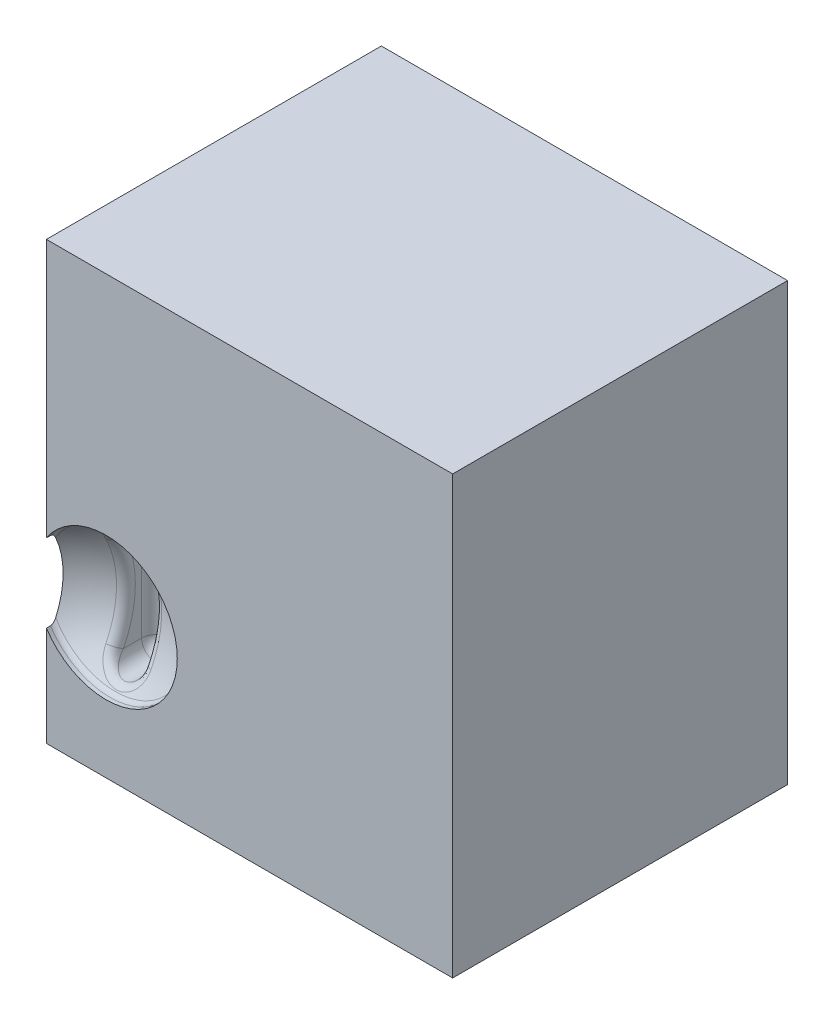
ISO-10303-21;
HEADER;
FILE_DESCRIPTION(('STEP AP214'),'2;1');
FILE_NAME('part.step','',(''),(''),'','','');
FILE_SCHEMA(('AUTOMOTIVE_DESIGN { 1 0 10303 214 1 1 1 1 }'));
ENDSEC;
DATA;
#1=APPLICATION_CONTEXT('core data for automotive mechanical design processes');
#2=APPLICATION_PROTOCOL_DEFINITION('international standard','automotive_design',2000,#1);
#3=PRODUCT_CONTEXT('',#1,'mechanical');
#4=PRODUCT('Part','Part','',(#3));
#5=PRODUCT_RELATED_PRODUCT_CATEGORY('part','',(#4));
#6=PRODUCT_DEFINITION_FORMATION('','',#4);
#7=PRODUCT_DEFINITION_CONTEXT('part definition',#1,'design');
#8=PRODUCT_DEFINITION('design','',#6,#7);
#9=PRODUCT_DEFINITION_SHAPE('','',#8);
#10=(LENGTH_UNIT() NAMED_UNIT(*) SI_UNIT(.MILLI.,.METRE.));
#11=(NAMED_UNIT(*) PLANE_ANGLE_UNIT() SI_UNIT($,.RADIAN.));
#12=(NAMED_UNIT(*) SI_UNIT($,.STERADIAN.) SOLID_ANGLE_UNIT());
#13=UNCERTAINTY_MEASURE_WITH_UNIT(LENGTH_MEASURE(1.E-05),#10,'distance_accuracy_value','');
#14=(GEOMETRIC_REPRESENTATION_CONTEXT(3) GLOBAL_UNCERTAINTY_ASSIGNED_CONTEXT((#13)) GLOBAL_UNIT_ASSIGNED_CONTEXT((#10,
#11,#12)) REPRESENTATION_CONTEXT('',''));
#15=CARTESIAN_POINT('',(0.,0.,0.));
#16=DIRECTION('',(0.,0.,1.));
#17=DIRECTION('',(1.,0.,0.));
#18=AXIS2_PLACEMENT_3D('',#15,#16,#17);
#19=CARTESIAN_POINT('',(0.,0.,-94.));
#20=DIRECTION('',(-1.,0.,0.));
#21=DIRECTION('',(0.,0.,1.));
#22=AXIS2_PLACEMENT_3D('',#19,#20,#21);
#23=PLANE('',#22);
#24=DIRECTION('',(0.,0.,1.));
#25=VECTOR('',#24,1.);
#26=CARTESIAN_POINT('',(0.,28.0263836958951,-0.0623058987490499));
#27=LINE('',#26,#25);
#28=CARTESIAN_POINT('',(0.,28.0263836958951,-1.1246117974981));
#29=VERTEX_POINT('',#28);
#30=CARTESIAN_POINT('',(0.,28.0263836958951,0.));
#31=VERTEX_POINT('',#30);
#32=EDGE_CURVE('E57',#29,#31,#27,.T.);
#33=ORIENTED_EDGE('',*,*,#32,.F.);
#34=CARTESIAN_POINT('',(0.,29.2960811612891,-2.61532378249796));
#35=CARTESIAN_POINT('',(0.,29.2196079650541,-2.58100001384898));
#36=CARTESIAN_POINT('',(0.,29.1441418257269,-2.54422921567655));
#37=CARTESIAN_POINT('',(0.,28.9957717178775,-2.4648907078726));
#38=CARTESIAN_POINT('',(0.,28.9228851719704,-2.42229057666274));
#39=CARTESIAN_POINT('',(0.,28.7798663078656,-2.32995526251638));
#40=CARTESIAN_POINT('',(0.,28.7098065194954,-2.28010614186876));
#41=CARTESIAN_POINT('',(0.,28.5756160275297,-2.17321519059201));
#42=CARTESIAN_POINT('',(0.,28.5114703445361,-2.11619244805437));
#43=CARTESIAN_POINT('',(0.,28.3975731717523,-2.00071403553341));
#44=CARTESIAN_POINT('',(0.,28.3470159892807,-1.94306288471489));
#45=CARTESIAN_POINT('',(0.,28.2545402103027,-1.82142104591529));
#46=CARTESIAN_POINT('',(0.,28.2125933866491,-1.75745212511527));
#47=CARTESIAN_POINT('',(0.,28.1392449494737,-1.62241602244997));
#48=CARTESIAN_POINT('',(0.,28.1079929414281,-1.55126485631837));
#49=CARTESIAN_POINT('',(0.,28.0718003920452,-1.44116861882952));
#50=CARTESIAN_POINT('',(0.,28.0615199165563,-1.40393028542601));
#51=CARTESIAN_POINT('',(0.,28.0447690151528,-1.3286159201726));
#52=CARTESIAN_POINT('',(0.,28.0382955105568,-1.29054059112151));
#53=CARTESIAN_POINT('',(0.,28.0313502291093,-1.231058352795));
#54=CARTESIAN_POINT('',(0.,28.029489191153,-1.20980469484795));
#55=CARTESIAN_POINT('',(0.,28.0270057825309,-1.1672394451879));
#56=CARTESIAN_POINT('',(0.,28.0263825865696,-1.14592790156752));
#57=CARTESIAN_POINT('',(0.,28.0263836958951,-1.1246117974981));
#58=B_SPLINE_CURVE_WITH_KNOTS('',3,(#34,#35,#36,#37,#38,#39,#40,#41,#42,#43,#44,#45,#46,#47,#48,
#49,#50,#51,#52,#53,#54,#55,#56,#57),.UNSPECIFIED.,.F.,.F.,(4,2,2,2,2,2,2,2,2,2,2,4),(0.,
0.251551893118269,0.504564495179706,0.76210015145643,1.01896448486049,1.24837557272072,
1.4770221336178,1.70874759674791,1.82447959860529,1.94011787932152,2.0040908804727,
2.06802121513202),.UNSPECIFIED.);
#59=CARTESIAN_POINT('',(0.,29.2960811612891,-2.61532378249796));
#60=VERTEX_POINT('',#59);
#61=EDGE_CURVE('E42',#60,#29,#58,.T.);
#62=ORIENTED_EDGE('',*,*,#61,.F.);
#63=CARTESIAN_POINT('',(0.,38.9874018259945,19.));
#64=DIRECTION('',(1.,0.,0.));
#65=DIRECTION('',(0.,0.,-1.));
#66=AXIS2_PLACEMENT_3D('',#63,#64,#65);
#67=CIRCLE('',#66,23.6884764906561);
#68=CARTESIAN_POINT('',(0.,48.6787224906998,-2.61532378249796));
#69=VERTEX_POINT('',#68);
#70=EDGE_CURVE('E590',#69,#60,#67,.F.);
#71=ORIENTED_EDGE('',*,*,#70,.F.);
#72=CARTESIAN_POINT('',(0.,49.9484199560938,-1.1246117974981));
#73=CARTESIAN_POINT('',(0.,49.9484309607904,-1.15721038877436));
#74=CARTESIAN_POINT('',(0.,49.9469660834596,-1.189803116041));
#75=CARTESIAN_POINT('',(0.,49.9411689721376,-1.2547089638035));
#76=CARTESIAN_POINT('',(0.,49.9368388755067,-1.28702227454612));
#77=CARTESIAN_POINT('',(0.,49.9254405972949,-1.35089800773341));
#78=CARTESIAN_POINT('',(0.,49.9183942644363,-1.38246434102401));
#79=CARTESIAN_POINT('',(0.,49.901713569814,-1.44490126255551));
#80=CARTESIAN_POINT('',(0.,49.8920788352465,-1.47577174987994));
#81=CARTESIAN_POINT('',(0.,49.8596108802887,-1.56690646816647));
#82=CARTESIAN_POINT('',(0.,49.833172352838,-1.62591635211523));
#83=CARTESIAN_POINT('',(0.,49.7722982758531,-1.73966577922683));
#84=CARTESIAN_POINT('',(0.,49.7378493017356,-1.79439794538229));
#85=CARTESIAN_POINT('',(0.,49.6388001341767,-1.93233332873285));
#86=CARTESIAN_POINT('',(0.,49.5688867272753,-2.01172185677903));
#87=CARTESIAN_POINT('',(0.,49.4173889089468,-2.15890385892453));
#88=CARTESIAN_POINT('',(0.,49.3357439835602,-2.22663294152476));
#89=CARTESIAN_POINT('',(0.,49.2056074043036,-2.32165590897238));
#90=CARTESIAN_POINT('',(0.,49.1598687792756,-2.35283215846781));
#91=CARTESIAN_POINT('',(0.,49.0666453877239,-2.41249201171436));
#92=CARTESIAN_POINT('',(0.,49.0191601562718,-2.4409748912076));
#93=CARTESIAN_POINT('',(0.,48.9234558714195,-2.49505368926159));
#94=CARTESIAN_POINT('',(0.,48.8752562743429,-2.52068431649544));
#95=CARTESIAN_POINT('',(0.,48.7777625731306,-2.56966316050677));
#96=CARTESIAN_POINT('',(0.,48.7284694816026,-2.59301338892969));
#97=CARTESIAN_POINT('',(0.,48.6787224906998,-2.61532378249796));
#98=B_SPLINE_CURVE_WITH_KNOTS('',3,(#72,#73,#74,#75,#76,#77,#78,#79,#80,#81,#82,#83,#84,#85,#86,
#87,#88,#89,#90,#91,#92,#93,#94,#95,#96,#97),.UNSPECIFIED.,.F.,.F.,(4,2,2,2,2,2,2,2,2,2,2,2,4),
(0.,0.0977533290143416,0.195433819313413,0.292344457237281,0.389269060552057,0.582447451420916,
0.775951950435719,1.09149918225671,1.40873676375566,1.57471904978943,1.74074584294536,
1.90445827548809,2.06802495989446),.UNSPECIFIED.);
#99=CARTESIAN_POINT('',(0.,49.9484199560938,-1.1246117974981));
#100=VERTEX_POINT('',#99);
#101=EDGE_CURVE('E591',#100,#69,#98,.T.);
#102=ORIENTED_EDGE('',*,*,#101,.F.);
#103=DIRECTION('',(0.,0.,1.));
#104=VECTOR('',#103,1.);
#105=CARTESIAN_POINT('',(0.,49.9484199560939,-0.0623058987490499));
#106=LINE('',#105,#104);
#107=CARTESIAN_POINT('',(0.,49.9484199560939,0.));
#108=VERTEX_POINT('',#107);
#109=EDGE_CURVE('E175',#108,#100,#106,.F.);
#110=ORIENTED_EDGE('',*,*,#109,.F.);
#111=DIRECTION('',(0.,-1.,0.));
#112=VECTOR('',#111,1.);
#113=CARTESIAN_POINT('',(0.,0.,0.));
#114=LINE('',#113,#112);
#115=CARTESIAN_POINT('',(0.,122.515793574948,0.));
#116=VERTEX_POINT('',#115);
#117=EDGE_CURVE('E565',#116,#108,#114,.T.);
#118=ORIENTED_EDGE('',*,*,#117,.F.);
#119=DIRECTION('',(0.,0.,1.));
#120=VECTOR('',#119,1.);
#121=CARTESIAN_POINT('',(0.,122.515793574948,-94.));
#122=LINE('',#121,#120);
#123=CARTESIAN_POINT('',(0.,122.515793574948,-94.));
#124=VERTEX_POINT('',#123);
#125=EDGE_CURVE('E581',#124,#116,#122,.T.);
#126=ORIENTED_EDGE('',*,*,#125,.F.);
#127=DIRECTION('',(0.,-1.,0.));
#128=VECTOR('',#127,1.);
#129=CARTESIAN_POINT('',(0.,0.,-94.));
#130=LINE('',#129,#128);
#131=CARTESIAN_POINT('',(0.,0.,-94.));
#132=VERTEX_POINT('',#131);
#133=EDGE_CURVE('E580',#124,#132,#130,.T.);
#134=ORIENTED_EDGE('',*,*,#133,.T.);
#135=DIRECTION('',(0.,0.,1.));
#136=VECTOR('',#135,1.);
#137=CARTESIAN_POINT('',(0.,0.,-94.));
#138=LINE('',#137,#136);
#139=CARTESIAN_POINT('',(0.,0.,0.));
#140=VERTEX_POINT('',#139);
#141=EDGE_CURVE('E561',#132,#140,#138,.T.);
#142=ORIENTED_EDGE('',*,*,#141,.T.);
#143=EDGE_CURVE('E559',#31,#140,#114,.T.);
#144=ORIENTED_EDGE('',*,*,#143,.F.);
#145=EDGE_LOOP('',(#33,#62,#71,#102,#110,#118,#126,#134,#142,#144));
#146=FACE_BOUND('',#145,.T.);
#147=ADVANCED_FACE('F33',(#146),#23,.T.);
#148=CARTESIAN_POINT('',(0.,122.515793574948,-94.));
#149=DIRECTION('',(0.,1.,0.));
#150=DIRECTION('',(0.,0.,1.));
#151=AXIS2_PLACEMENT_3D('',#148,#149,#150);
#152=PLANE('',#151);
#153=DIRECTION('',(-1.,0.,0.));
#154=VECTOR('',#153,1.);
#155=CARTESIAN_POINT('',(0.,122.515793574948,0.));
#156=LINE('',#155,#154);
#157=CARTESIAN_POINT('',(114.017650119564,122.515793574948,0.));
#158=VERTEX_POINT('',#157);
#159=EDGE_CURVE('E577',#158,#116,#156,.T.);
#160=ORIENTED_EDGE('',*,*,#159,.F.);
#161=DIRECTION('',(0.,0.,1.));
#162=VECTOR('',#161,1.);
#163=CARTESIAN_POINT('',(114.017650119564,122.515793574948,-94.));
#164=LINE('',#163,#162);
#165=CARTESIAN_POINT('',(114.017650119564,122.515793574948,-94.));
#166=VERTEX_POINT('',#165);
#167=EDGE_CURVE('E584',#166,#158,#164,.T.);
#168=ORIENTED_EDGE('',*,*,#167,.F.);
#169=DIRECTION('',(-1.,0.,0.));
#170=VECTOR('',#169,1.);
#171=CARTESIAN_POINT('',(0.,122.515793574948,-94.));
#172=LINE('',#171,#170);
#173=EDGE_CURVE('E571',#166,#124,#172,.T.);
#174=ORIENTED_EDGE('',*,*,#173,.T.);
#175=ORIENTED_EDGE('',*,*,#125,.T.);
#176=EDGE_LOOP('',(#160,#168,#174,#175));
#177=FACE_BOUND('',#176,.T.);
#178=ADVANCED_FACE('F548',(#177),#152,.T.);
#179=CARTESIAN_POINT('',(114.017650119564,0.,-94.));
#180=DIRECTION('',(1.,0.,0.));
#181=DIRECTION('',(0.,0.,-1.));
#182=AXIS2_PLACEMENT_3D('',#179,#180,#181);
#183=PLANE('',#182);
#184=DIRECTION('',(0.,1.,0.));
#185=VECTOR('',#184,1.);
#186=CARTESIAN_POINT('',(114.017650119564,0.,0.));
#187=LINE('',#186,#185);
#188=CARTESIAN_POINT('',(114.017650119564,0.,0.));
#189=VERTEX_POINT('',#188);
#190=EDGE_CURVE('E574',#189,#158,#187,.T.);
#191=ORIENTED_EDGE('',*,*,#190,.F.);
#192=DIRECTION('',(0.,0.,1.));
#193=VECTOR('',#192,1.);
#194=CARTESIAN_POINT('',(114.017650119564,0.,-94.));
#195=LINE('',#194,#193);
#196=CARTESIAN_POINT('',(114.017650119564,0.,-94.));
#197=VERTEX_POINT('',#196);
#198=EDGE_CURVE('E586',#197,#189,#195,.T.);
#199=ORIENTED_EDGE('',*,*,#198,.F.);
#200=DIRECTION('',(0.,1.,0.));
#201=VECTOR('',#200,1.);
#202=CARTESIAN_POINT('',(114.017650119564,0.,-94.));
#203=LINE('',#202,#201);
#204=EDGE_CURVE('E780',#197,#166,#203,.T.);
#205=ORIENTED_EDGE('',*,*,#204,.T.);
#206=ORIENTED_EDGE('',*,*,#167,.T.);
#207=EDGE_LOOP('',(#191,#199,#205,#206));
#208=FACE_BOUND('',#207,.T.);
#209=ADVANCED_FACE('F553',(#208),#183,.T.);
#210=CARTESIAN_POINT('',(0.,0.,-94.));
#211=DIRECTION('',(0.,-1.,0.));
#212=DIRECTION('',(0.,0.,-1.));
#213=AXIS2_PLACEMENT_3D('',#210,#211,#212);
#214=PLANE('',#213);
#215=DIRECTION('',(1.,0.,0.));
#216=VECTOR('',#215,1.);
#217=CARTESIAN_POINT('',(0.,0.,0.));
#218=LINE('',#217,#216);
#219=EDGE_CURVE('E568',#140,#189,#218,.T.);
#220=ORIENTED_EDGE('',*,*,#219,.F.);
#221=ORIENTED_EDGE('',*,*,#141,.F.);
#222=DIRECTION('',(1.,0.,0.));
#223=VECTOR('',#222,1.);
#224=CARTESIAN_POINT('',(0.,0.,-94.));
#225=LINE('',#224,#223);
#226=EDGE_CURVE('E778',#132,#197,#225,.T.);
#227=ORIENTED_EDGE('',*,*,#226,.T.);
#228=ORIENTED_EDGE('',*,*,#198,.T.);
#229=EDGE_LOOP('',(#220,#221,#227,#228));
#230=FACE_BOUND('',#229,.T.);
#231=ADVANCED_FACE('F741',(#230),#214,.T.);
#232=CARTESIAN_POINT('',(0.,122.515793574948,-94.));
#233=DIRECTION('',(0.,0.,-1.));
#234=DIRECTION('',(-1.,0.,0.));
#235=AXIS2_PLACEMENT_3D('',#232,#233,#234);
#236=PLANE('',#235);
#237=ORIENTED_EDGE('',*,*,#133,.F.);
#238=ORIENTED_EDGE('',*,*,#173,.F.);
#239=ORIENTED_EDGE('',*,*,#204,.F.);
#240=ORIENTED_EDGE('',*,*,#226,.F.);
#241=EDGE_LOOP('',(#237,#238,#239,#240));
#242=FACE_BOUND('',#241,.T.);
#243=ADVANCED_FACE('F662',(#242),#236,.T.);
#244=CARTESIAN_POINT('',(0.,122.515793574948,0.));
#245=DIRECTION('',(0.,0.,-1.));
#246=DIRECTION('',(-1.,0.,0.));
#247=AXIS2_PLACEMENT_3D('',#244,#245,#246);
#248=PLANE('',#247);
#249=ORIENTED_EDGE('',*,*,#117,.T.);
#250=CARTESIAN_POINT('',(16.7288995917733,38.9874018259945,0.));
#251=DIRECTION('',(0.,0.,-1.));
#252=DIRECTION('',(-1.,0.,0.));
#253=AXIS2_PLACEMENT_3D('',#250,#251,#252);
#254=CIRCLE('',#253,20.);
#255=EDGE_CURVE('E583',#108,#31,#254,.T.);
#256=ORIENTED_EDGE('',*,*,#255,.T.);
#257=ORIENTED_EDGE('',*,*,#143,.T.);
#258=ORIENTED_EDGE('',*,*,#219,.T.);
#259=ORIENTED_EDGE('',*,*,#190,.T.);
#260=ORIENTED_EDGE('',*,*,#159,.T.);
#261=EDGE_LOOP('',(#249,#256,#257,#258,#259,#260));
#262=FACE_BOUND('',#261,.T.);
#263=ADVANCED_FACE('F466',(#262),#248,.F.);
#264=CARTESIAN_POINT('',(17.2288995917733,38.9874018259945,-16.9580398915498));
#265=DIRECTION('',(-1.,0.,0.));
#266=DIRECTION('',(0.,1.,0.));
#267=AXIS2_PLACEMENT_3D('',#264,#265,#266);
#268=PLANE('',#267);
#269=DIRECTION('',(0.,0.,1.));
#270=VECTOR('',#269,1.);
#271=CARTESIAN_POINT('',(17.2288995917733,24.9874018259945,-17.4633334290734));
#272=LINE('',#271,#270);
#273=CARTESIAN_POINT('',(17.2288995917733,24.9874018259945,-17.9686269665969));
#274=VERTEX_POINT('',#273);
#275=CARTESIAN_POINT('',(17.2288995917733,24.9874018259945,-16.9580398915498));
#276=VERTEX_POINT('',#275);
#277=EDGE_CURVE('E49',#274,#276,#272,.T.);
#278=ORIENTED_EDGE('',*,*,#277,.F.);
#279=DIRECTION('',(0.,1.,0.));
#280=VECTOR('',#279,1.);
#281=CARTESIAN_POINT('',(17.2288995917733,38.9874018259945,-17.9686269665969));
#282=LINE('',#281,#280);
#283=CARTESIAN_POINT('',(17.2288995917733,52.9874018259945,-17.9686269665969));
#284=VERTEX_POINT('',#283);
#285=EDGE_CURVE('E171',#274,#284,#282,.T.);
#286=ORIENTED_EDGE('',*,*,#285,.T.);
#287=DIRECTION('',(0.,0.,1.));
#288=VECTOR('',#287,1.);
#289=CARTESIAN_POINT('',(17.2288995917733,52.9874018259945,-17.4633334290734));
#290=LINE('',#289,#288);
#291=CARTESIAN_POINT('',(17.2288995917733,52.9874018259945,-16.9580398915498));
#292=VERTEX_POINT('',#291);
#293=EDGE_CURVE('E159',#292,#284,#290,.F.);
#294=ORIENTED_EDGE('',*,*,#293,.F.);
#295=DIRECTION('',(0.,-1.,0.));
#296=VECTOR('',#295,1.);
#297=CARTESIAN_POINT('',(17.2288995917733,24.9874018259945,-16.9580398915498));
#298=LINE('',#297,#296);
#299=EDGE_CURVE('E166',#292,#276,#298,.T.);
#300=ORIENTED_EDGE('',*,*,#299,.T.);
#301=EDGE_LOOP('',(#278,#286,#294,#300));
#302=FACE_BOUND('',#301,.T.);
#303=ADVANCED_FACE('F169',(#302),#268,.F.);
#304=CARTESIAN_POINT('',(16.7288995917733,52.9874018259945,-17.4633334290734));
#305=DIRECTION('',(0.,0.,1.));
#306=DIRECTION('',(0.,-1.,0.));
#307=AXIS2_PLACEMENT_3D('',#304,#305,#306);
#308=CYLINDRICAL_SURFACE('',#307,0.5);
#309=CARTESIAN_POINT('',(16.7288995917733,52.9874018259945,-17.9686269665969));
#310=DIRECTION('',(0.,0.,1.));
#311=DIRECTION('',(0.,-1.,0.));
#312=AXIS2_PLACEMENT_3D('',#309,#310,#311);
#313=CIRCLE('',#312,0.5);
#314=CARTESIAN_POINT('',(16.2288995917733,52.9874018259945,-17.9686269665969));
#315=VERTEX_POINT('',#314);
#316=EDGE_CURVE('E205',#284,#315,#313,.T.);
#317=ORIENTED_EDGE('',*,*,#316,.T.);
#318=DIRECTION('',(0.,0.,-1.));
#319=VECTOR('',#318,1.);
#320=CARTESIAN_POINT('',(16.2288995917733,52.9874018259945,-16.9580398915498));
#321=LINE('',#320,#319);
#322=CARTESIAN_POINT('',(16.2288995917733,52.9874018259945,-16.9580398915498));
#323=VERTEX_POINT('',#322);
#324=EDGE_CURVE('E161',#315,#323,#321,.F.);
#325=ORIENTED_EDGE('',*,*,#324,.T.);
#326=CARTESIAN_POINT('',(16.7288995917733,52.9874018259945,-16.9580398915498));
#327=DIRECTION('',(0.,0.,-1.));
#328=DIRECTION('',(0.,1.,0.));
#329=AXIS2_PLACEMENT_3D('',#326,#327,#328);
#330=CIRCLE('',#329,0.500000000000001);
#331=EDGE_CURVE('E155',#323,#292,#330,.T.);
#332=ORIENTED_EDGE('',*,*,#331,.T.);
#333=ORIENTED_EDGE('',*,*,#293,.T.);
#334=EDGE_LOOP('',(#317,#325,#332,#333));
#335=FACE_BOUND('',#334,.T.);
#336=ADVANCED_FACE('F158',(#335),#308,.T.);
#337=CARTESIAN_POINT('',(16.2288995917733,52.9874018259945,-16.9580398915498));
#338=DIRECTION('',(1.,0.,0.));
#339=DIRECTION('',(0.,-1.,0.));
#340=AXIS2_PLACEMENT_3D('',#337,#338,#339);
#341=PLANE('',#340);
#342=ORIENTED_EDGE('',*,*,#324,.F.);
#343=DIRECTION('',(0.,-1.,0.));
#344=VECTOR('',#343,1.);
#345=CARTESIAN_POINT('',(16.2288995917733,52.9874018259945,-17.9686269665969));
#346=LINE('',#345,#344);
#347=CARTESIAN_POINT('',(16.2288995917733,24.9874018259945,-17.9686269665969));
#348=VERTEX_POINT('',#347);
#349=EDGE_CURVE('E211',#315,#348,#346,.T.);
#350=ORIENTED_EDGE('',*,*,#349,.T.);
#351=DIRECTION('',(0.,0.,1.));
#352=VECTOR('',#351,1.);
#353=CARTESIAN_POINT('',(16.2288995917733,24.9874018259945,-17.4633334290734));
#354=LINE('',#353,#352);
#355=CARTESIAN_POINT('',(16.2288995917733,24.9874018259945,-16.9580398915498));
#356=VERTEX_POINT('',#355);
#357=EDGE_CURVE('E194',#356,#348,#354,.F.);
#358=ORIENTED_EDGE('',*,*,#357,.F.);
#359=DIRECTION('',(0.,1.,0.));
#360=VECTOR('',#359,1.);
#361=CARTESIAN_POINT('',(16.2288995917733,52.9874018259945,-16.9580398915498));
#362=LINE('',#361,#360);
#363=EDGE_CURVE('E165',#356,#323,#362,.T.);
#364=ORIENTED_EDGE('',*,*,#363,.T.);
#365=EDGE_LOOP('',(#342,#350,#358,#364));
#366=FACE_BOUND('',#365,.T.);
#367=ADVANCED_FACE('F660',(#366),#341,.F.);
#368=CARTESIAN_POINT('',(16.7288995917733,24.9874018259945,-17.4633334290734));
#369=DIRECTION('',(0.,0.,1.));
#370=DIRECTION('',(0.,-1.,0.));
#371=AXIS2_PLACEMENT_3D('',#368,#369,#370);
#372=CYLINDRICAL_SURFACE('',#371,0.5);
#373=CARTESIAN_POINT('',(16.7288995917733,24.9874018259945,-17.9686269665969));
#374=DIRECTION('',(0.,0.,1.));
#375=DIRECTION('',(0.,-1.,0.));
#376=AXIS2_PLACEMENT_3D('',#373,#374,#375);
#377=CIRCLE('',#376,0.5);
#378=EDGE_CURVE('E482',#348,#274,#377,.T.);
#379=ORIENTED_EDGE('',*,*,#378,.T.);
#380=ORIENTED_EDGE('',*,*,#277,.T.);
#381=CARTESIAN_POINT('',(16.7288995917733,24.9874018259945,-16.9580398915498));
#382=DIRECTION('',(0.,0.,-1.));
#383=DIRECTION('',(0.,1.,0.));
#384=AXIS2_PLACEMENT_3D('',#381,#382,#383);
#385=CIRCLE('',#384,0.500000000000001);
#386=EDGE_CURVE('E11',#276,#356,#385,.T.);
#387=ORIENTED_EDGE('',*,*,#386,.T.);
#388=ORIENTED_EDGE('',*,*,#357,.T.);
#389=EDGE_LOOP('',(#379,#380,#387,#388));
#390=FACE_BOUND('',#389,.T.);
#391=ADVANCED_FACE('F666',(#390),#372,.T.);
#392=CARTESIAN_POINT('',(16.7288995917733,38.9874018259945,-14.));
#393=DIRECTION('',(0.,1.,0.));
#394=DIRECTION('',(1.,0.,0.));
#395=AXIS2_PLACEMENT_3D('',#392,#393,#394);
#396=CYLINDRICAL_SURFACE('',#395,4.);
#397=CARTESIAN_POINT('',(16.7288995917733,24.9874018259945,-14.));
#398=DIRECTION('',(0.,1.,0.));
#399=DIRECTION('',(1.,0.,0.));
#400=AXIS2_PLACEMENT_3D('',#397,#398,#399);
#401=CIRCLE('',#400,4.);
#402=CARTESIAN_POINT('',(20.7288995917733,24.9874018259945,-14.));
#403=VERTEX_POINT('',#402);
#404=EDGE_CURVE('E250',#274,#403,#401,.F.);
#405=ORIENTED_EDGE('',*,*,#404,.T.);
#406=DIRECTION('',(0.,-1.,0.));
#407=VECTOR('',#406,1.);
#408=CARTESIAN_POINT('',(20.7288995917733,38.9874018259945,-14.));
#409=LINE('',#408,#407);
#410=CARTESIAN_POINT('',(20.7288995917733,52.9874018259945,-14.));
#411=VERTEX_POINT('',#410);
#412=EDGE_CURVE('E247',#403,#411,#409,.F.);
#413=ORIENTED_EDGE('',*,*,#412,.T.);
#414=CARTESIAN_POINT('',(16.7288995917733,52.9874018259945,-14.));
#415=DIRECTION('',(0.,1.,0.));
#416=DIRECTION('',(1.,0.,0.));
#417=AXIS2_PLACEMENT_3D('',#414,#415,#416);
#418=CIRCLE('',#417,4.);
#419=EDGE_CURVE('E202',#411,#284,#418,.T.);
#420=ORIENTED_EDGE('',*,*,#419,.T.);
#421=ORIENTED_EDGE('',*,*,#285,.F.);
#422=EDGE_LOOP('',(#405,#413,#420,#421));
#423=FACE_BOUND('',#422,.T.);
#424=ADVANCED_FACE('F225',(#423),#396,.F.);
#425=CARTESIAN_POINT('',(16.7288995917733,52.9874018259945,-14.));
#426=DIRECTION('',(1.,0.,0.));
#427=DIRECTION('',(0.,0.,-1.));
#428=AXIS2_PLACEMENT_3D('',#425,#426,#427);
#429=SPHERICAL_SURFACE('',#428,4.);
#430=ORIENTED_EDGE('',*,*,#419,.F.);
#431=CARTESIAN_POINT('',(16.7288995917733,52.9874018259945,-14.));
#432=DIRECTION('',(0.,0.,1.));
#433=DIRECTION('',(0.,-1.,0.));
#434=AXIS2_PLACEMENT_3D('',#431,#432,#433);
#435=CIRCLE('',#434,4.);
#436=CARTESIAN_POINT('',(12.7288995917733,52.9874018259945,-14.));
#437=VERTEX_POINT('',#436);
#438=EDGE_CURVE('E217',#411,#437,#435,.T.);
#439=ORIENTED_EDGE('',*,*,#438,.T.);
#440=CARTESIAN_POINT('',(16.7288995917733,52.9874018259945,-14.));
#441=DIRECTION('',(0.,-1.,0.));
#442=DIRECTION('',(-1.,0.,0.));
#443=AXIS2_PLACEMENT_3D('',#440,#441,#442);
#444=CIRCLE('',#443,4.);
#445=EDGE_CURVE('E213',#437,#315,#444,.T.);
#446=ORIENTED_EDGE('',*,*,#445,.T.);
#447=ORIENTED_EDGE('',*,*,#316,.F.);
#448=EDGE_LOOP('',(#430,#439,#446,#447));
#449=FACE_BOUND('',#448,.T.);
#450=ADVANCED_FACE('F220',(#449),#429,.F.);
#451=CARTESIAN_POINT('',(16.7288995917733,52.9874018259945,-14.));
#452=DIRECTION('',(0.,-1.,0.));
#453=DIRECTION('',(-1.,0.,0.));
#454=AXIS2_PLACEMENT_3D('',#451,#452,#453);
#455=CYLINDRICAL_SURFACE('',#454,4.);
#456=ORIENTED_EDGE('',*,*,#445,.F.);
#457=DIRECTION('',(0.,1.,0.));
#458=VECTOR('',#457,1.);
#459=CARTESIAN_POINT('',(12.7288995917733,52.9874018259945,-14.));
#460=LINE('',#459,#458);
#461=CARTESIAN_POINT('',(12.7288995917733,24.9874018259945,-14.));
#462=VERTEX_POINT('',#461);
#463=EDGE_CURVE('E311',#437,#462,#460,.F.);
#464=ORIENTED_EDGE('',*,*,#463,.T.);
#465=CARTESIAN_POINT('',(16.7288995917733,24.9874018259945,-14.));
#466=DIRECTION('',(0.,1.,0.));
#467=DIRECTION('',(1.,0.,0.));
#468=AXIS2_PLACEMENT_3D('',#465,#466,#467);
#469=CIRCLE('',#468,4.);
#470=EDGE_CURVE('E212',#462,#348,#469,.F.);
#471=ORIENTED_EDGE('',*,*,#470,.T.);
#472=ORIENTED_EDGE('',*,*,#349,.F.);
#473=EDGE_LOOP('',(#456,#464,#471,#472));
#474=FACE_BOUND('',#473,.T.);
#475=ADVANCED_FACE('F224',(#474),#455,.F.);
#476=CARTESIAN_POINT('',(16.7288995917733,24.9874018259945,-14.));
#477=DIRECTION('',(1.,0.,0.));
#478=DIRECTION('',(0.,0.,-1.));
#479=AXIS2_PLACEMENT_3D('',#476,#477,#478);
#480=SPHERICAL_SURFACE('',#479,4.);
#481=ORIENTED_EDGE('',*,*,#470,.F.);
#482=CARTESIAN_POINT('',(16.7288995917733,24.9874018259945,-14.));
#483=DIRECTION('',(0.,0.,1.));
#484=DIRECTION('',(0.,-1.,0.));
#485=AXIS2_PLACEMENT_3D('',#482,#483,#484);
#486=CIRCLE('',#485,4.);
#487=EDGE_CURVE('E242',#462,#403,#486,.T.);
#488=ORIENTED_EDGE('',*,*,#487,.T.);
#489=ORIENTED_EDGE('',*,*,#404,.F.);
#490=ORIENTED_EDGE('',*,*,#378,.F.);
#491=EDGE_LOOP('',(#481,#488,#489,#490));
#492=FACE_BOUND('',#491,.T.);
#493=ADVANCED_FACE('F230',(#492),#480,.F.);
#494=CARTESIAN_POINT('',(16.7288995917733,38.9874018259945,-0.0623058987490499));
#495=DIRECTION('',(0.,0.,1.));
#496=DIRECTION('',(0.,-1.,0.));
#497=AXIS2_PLACEMENT_3D('',#494,#495,#496);
#498=CYLINDRICAL_SURFACE('',#497,20.);
#499=ORIENTED_EDGE('',*,*,#32,.T.);
#500=ORIENTED_EDGE('',*,*,#255,.F.);
#501=ORIENTED_EDGE('',*,*,#109,.T.);
#502=CARTESIAN_POINT('',(16.7288995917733,38.9874018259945,-1.1246117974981));
#503=DIRECTION('',(0.,0.,1.));
#504=DIRECTION('',(0.,-1.,0.));
#505=AXIS2_PLACEMENT_3D('',#502,#503,#504);
#506=CIRCLE('',#505,20.);
#507=EDGE_CURVE('E356',#100,#29,#506,.F.);
#508=ORIENTED_EDGE('',*,*,#507,.T.);
#509=EDGE_LOOP('',(#499,#500,#501,#508));
#510=FACE_BOUND('',#509,.T.);
#511=ADVANCED_FACE('F235',(#510),#498,.F.);
#512=CARTESIAN_POINT('',(20.7288995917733,38.9874018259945,-14.));
#513=DIRECTION('',(1.,0.,0.));
#514=DIRECTION('',(0.,-1.,0.));
#515=AXIS2_PLACEMENT_3D('',#512,#513,#514);
#516=PLANE('',#515);
#517=ORIENTED_EDGE('',*,*,#412,.F.);
#518=DIRECTION('',(0.,0.,1.));
#519=VECTOR('',#518,1.);
#520=CARTESIAN_POINT('',(20.7288995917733,24.9874018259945,-6.5));
#521=LINE('',#520,#519);
#522=CARTESIAN_POINT('',(20.7288995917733,24.9874018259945,-8.91057147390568));
#523=VERTEX_POINT('',#522);
#524=EDGE_CURVE('E245',#403,#523,#521,.T.);
#525=ORIENTED_EDGE('',*,*,#524,.T.);
#526=CARTESIAN_POINT('',(20.7288995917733,38.9874018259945,19.));
#527=DIRECTION('',(1.,0.,0.));
#528=DIRECTION('',(0.,0.,-1.));
#529=AXIS2_PLACEMENT_3D('',#526,#527,#528);
#530=CIRCLE('',#529,31.2249899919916);
#531=CARTESIAN_POINT('',(20.7288995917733,52.9874018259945,-8.91057147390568));
#532=VERTEX_POINT('',#531);
#533=EDGE_CURVE('E358',#523,#532,#530,.T.);
#534=ORIENTED_EDGE('',*,*,#533,.T.);
#535=DIRECTION('',(0.,0.,1.));
#536=VECTOR('',#535,1.);
#537=CARTESIAN_POINT('',(20.7288995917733,52.9874018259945,-6.5));
#538=LINE('',#537,#536);
#539=EDGE_CURVE('E308',#532,#411,#538,.F.);
#540=ORIENTED_EDGE('',*,*,#539,.T.);
#541=EDGE_LOOP('',(#517,#525,#534,#540));
#542=FACE_BOUND('',#541,.T.);
#543=ADVANCED_FACE('F325',(#542),#516,.F.);
#544=CARTESIAN_POINT('',(16.7288995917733,52.9874018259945,-6.5));
#545=DIRECTION('',(0.,0.,1.));
#546=DIRECTION('',(0.,-1.,0.));
#547=AXIS2_PLACEMENT_3D('',#544,#545,#546);
#548=CYLINDRICAL_SURFACE('',#547,4.);
#549=ORIENTED_EDGE('',*,*,#438,.F.);
#550=ORIENTED_EDGE('',*,*,#539,.F.);
#551=CARTESIAN_POINT('',(12.7288995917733,52.9874018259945,-8.91057147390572));
#552=CARTESIAN_POINT('',(12.7288995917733,53.2003713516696,-8.72362605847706));
#553=CARTESIAN_POINT('',(12.75175125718,53.4851143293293,-8.47113158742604));
#554=CARTESIAN_POINT('',(12.8570271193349,54.0433769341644,-7.96925697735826));
#555=CARTESIAN_POINT('',(13.0371850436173,54.5879494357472,-7.470922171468));
#556=CARTESIAN_POINT('',(13.3177078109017,55.0928506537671,-6.9975992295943));
#557=CARTESIAN_POINT('',(13.5714364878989,55.450779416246,-6.6576811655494));
#558=CARTESIAN_POINT('',(13.8095338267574,55.7339935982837,-6.38601889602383));
#559=CARTESIAN_POINT('',(14.0802778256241,55.9914427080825,-6.13597666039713));
#560=CARTESIAN_POINT('',(14.3141300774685,56.1789266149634,-5.95238049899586));
#561=CARTESIAN_POINT('',(14.6854349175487,56.4439881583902,-5.69141040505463));
#562=CARTESIAN_POINT('',(15.1710742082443,56.694784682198,-5.440905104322));
#563=CARTESIAN_POINT('',(15.8211843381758,56.8963470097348,-5.23773023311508));
#564=CARTESIAN_POINT('',(16.4038999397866,56.9913889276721,-5.14135923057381));
#565=CARTESIAN_POINT('',(17.0408249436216,56.9921295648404,-5.14059392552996));
#566=CARTESIAN_POINT('',(17.5707676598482,56.9080423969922,-5.22588335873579));
#567=CARTESIAN_POINT('',(17.9758101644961,56.7922406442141,-5.34267584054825));
#568=CARTESIAN_POINT('',(18.5611864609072,56.5754253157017,-5.56050069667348));
#569=CARTESIAN_POINT('',(19.1380615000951,56.2186710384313,-5.91525890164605));
#570=CARTESIAN_POINT('',(19.6402647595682,55.7418873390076,-6.37837131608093));
#571=CARTESIAN_POINT('',(19.928147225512,55.402485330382,-6.70408350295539));
#572=CARTESIAN_POINT('',(20.1730847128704,55.0367884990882,-7.05035261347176));
#573=CARTESIAN_POINT('',(20.4403822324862,54.5267943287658,-7.5268246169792));
#574=CARTESIAN_POINT('',(20.6677181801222,53.8438065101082,-8.1519952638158));
#575=CARTESIAN_POINT('',(20.7288995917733,53.2713611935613,-8.66131092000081));
#576=CARTESIAN_POINT('',(20.7288995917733,52.9874018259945,-8.91057147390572));
#577=B_SPLINE_CURVE_WITH_KNOTS('',3,(#551,#552,#553,#554,#555,#556,#557,#558,#559,#560,#561,
#562,#563,#564,#565,#566,#567,#568,#569,#570,#571,#572,#573,#574,#575,#576),.UNSPECIFIED.,.F.,
.F.,(4,1,1,1,1,1,1,1,1,1,1,1,1,1,1,1,1,1,1,1,1,1,1,4),(0.,0.125086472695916,0.166781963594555,
0.33356392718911,0.458650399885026,0.500345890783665,0.583736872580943,0.66712785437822,
0.708823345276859,0.750518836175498,0.917300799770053,1.00069178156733,1.11187975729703,
1.22306773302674,1.33425570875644,1.38984969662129,1.44544368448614,1.66781963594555,
1.75121061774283,1.83460159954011,1.91799258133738,2.00138356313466,2.16816552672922,
2.33494749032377),.UNSPECIFIED.);
#578=CARTESIAN_POINT('',(12.7288995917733,52.9874018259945,-8.91057147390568));
#579=VERTEX_POINT('',#578);
#580=EDGE_CURVE('E305',#532,#579,#577,.F.);
#581=ORIENTED_EDGE('',*,*,#580,.T.);
#582=DIRECTION('',(0.,0.,-1.));
#583=VECTOR('',#582,1.);
#584=CARTESIAN_POINT('',(12.7288995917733,52.9874018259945,-14.));
#585=LINE('',#584,#583);
#586=EDGE_CURVE('E246',#579,#437,#585,.T.);
#587=ORIENTED_EDGE('',*,*,#586,.T.);
#588=EDGE_LOOP('',(#549,#550,#581,#587));
#589=FACE_BOUND('',#588,.T.);
#590=ADVANCED_FACE('F315',(#589),#548,.F.);
#591=CARTESIAN_POINT('',(12.7288995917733,52.9874018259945,-14.));
#592=DIRECTION('',(-1.,0.,0.));
#593=DIRECTION('',(0.,1.,0.));
#594=AXIS2_PLACEMENT_3D('',#591,#592,#593);
#595=PLANE('',#594);
#596=ORIENTED_EDGE('',*,*,#463,.F.);
#597=ORIENTED_EDGE('',*,*,#586,.F.);
#598=CARTESIAN_POINT('',(12.7288995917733,52.9874018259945,-8.91057147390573));
#599=CARTESIAN_POINT('',(12.7288995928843,52.7503047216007,-9.02948274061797));
#600=CARTESIAN_POINT('',(12.7288995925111,52.5117010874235,-9.14539530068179));
#601=CARTESIAN_POINT('',(12.7288995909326,52.0316305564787,-9.37113068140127));
#602=CARTESIAN_POINT('',(12.7288995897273,51.7901636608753,-9.48095350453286));
#603=CARTESIAN_POINT('',(12.7288995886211,51.3045156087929,-9.69441744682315));
#604=CARTESIAN_POINT('',(12.7288995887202,51.0603344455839,-9.79805855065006));
#605=CARTESIAN_POINT('',(12.728899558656,50.5413916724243,-10.0106897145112));
#606=CARTESIAN_POINT('',(12.7288995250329,50.2663244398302,-10.1189374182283));
#607=CARTESIAN_POINT('',(12.7288995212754,49.9279534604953,-10.246356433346));
#608=CARTESIAN_POINT('',(12.7288995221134,49.8661001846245,-10.2694154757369));
#609=CARTESIAN_POINT('',(12.7288995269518,49.6299369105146,-10.356597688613));
#610=CARTESIAN_POINT('',(12.7288995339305,49.4551181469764,-10.4193508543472));
#611=CARTESIAN_POINT('',(12.7288995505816,48.9930394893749,-10.5805809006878));
#612=CARTESIAN_POINT('',(12.7288995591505,48.7048674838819,-10.6764400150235));
#613=CARTESIAN_POINT('',(12.7288995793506,47.9057296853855,-10.929367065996));
#614=CARTESIAN_POINT('',(12.7288995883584,47.3919138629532,-11.0775756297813));
#615=CARTESIAN_POINT('',(12.7288995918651,46.671950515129,-11.2653896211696));
#616=CARTESIAN_POINT('',(12.7288995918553,46.4686654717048,-11.31624163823));
#617=CARTESIAN_POINT('',(12.7288995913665,46.0007336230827,-11.4283266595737));
#618=CARTESIAN_POINT('',(12.7288995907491,45.7357510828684,-11.4881715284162));
#619=CARTESIAN_POINT('',(12.72889959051,45.2043245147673,-11.6009521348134));
#620=CARTESIAN_POINT('',(12.7288995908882,44.9378804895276,-11.6538878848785));
#621=CARTESIAN_POINT('',(12.7288995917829,44.4037051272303,-11.752817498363));
#622=CARTESIAN_POINT('',(12.7288995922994,44.1359737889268,-11.798811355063));
#623=CARTESIAN_POINT('',(12.7288995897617,43.5994067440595,-11.8838265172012));
#624=CARTESIAN_POINT('',(12.7288995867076,43.3305710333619,-11.9228477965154));
#625=CARTESIAN_POINT('',(12.7288995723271,42.7919698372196,-11.9938875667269));
#626=CARTESIAN_POINT('',(12.7288995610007,42.5222043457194,-12.0259060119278));
#627=CARTESIAN_POINT('',(12.7288995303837,42.144022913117,-12.0658257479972));
#628=CARTESIAN_POINT('',(12.7288995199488,42.0359108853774,-12.0766708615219));
#629=CARTESIAN_POINT('',(12.7288994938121,41.7649698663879,-12.1024104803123));
#630=CARTESIAN_POINT('',(12.7288994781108,41.6020718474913,-12.116585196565));
#631=CARTESIAN_POINT('',(12.7288994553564,41.1674055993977,-12.1508969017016));
#632=CARTESIAN_POINT('',(12.728899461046,40.8954514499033,-12.1687094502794));
#633=CARTESIAN_POINT('',(12.7288995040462,40.3511702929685,-12.1971260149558));
#634=CARTESIAN_POINT('',(12.7288995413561,40.0788432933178,-12.2077301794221));
#635=CARTESIAN_POINT('',(12.7288995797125,39.674113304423,-12.2179828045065));
#636=CARTESIAN_POINT('',(12.7288995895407,39.5417771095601,-12.2204609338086));
#637=CARTESIAN_POINT('',(12.7288995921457,39.3652398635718,-12.2227524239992));
#638=CARTESIAN_POINT('',(12.7288995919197,39.3210468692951,-12.2232412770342));
#639=CARTESIAN_POINT('',(12.728899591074,39.0807438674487,-12.2254145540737));
#640=CARTESIAN_POINT('',(12.7288995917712,38.884616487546,-12.2254323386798));
#641=CARTESIAN_POINT('',(12.7288995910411,38.3468764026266,-12.2204067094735));
#642=CARTESIAN_POINT('',(12.7288995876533,38.0052912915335,-12.2115981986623));
#643=CARTESIAN_POINT('',(12.7288995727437,37.4036083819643,-12.1862281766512));
#644=CARTESIAN_POINT('',(12.7288995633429,37.1434092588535,-12.1720025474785));
#645=CARTESIAN_POINT('',(12.7288995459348,36.7674345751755,-12.1467188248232));
#646=CARTESIAN_POINT('',(12.728899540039,36.6514792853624,-12.1382695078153));
#647=CARTESIAN_POINT('',(12.7288995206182,36.2651318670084,-12.1079389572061));
#648=CARTESIAN_POINT('',(12.7288995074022,35.9949597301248,-12.0831691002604));
#649=CARTESIAN_POINT('',(12.7288994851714,35.4553589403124,-12.0265738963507));
#650=CARTESIAN_POINT('',(12.7288994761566,35.1859302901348,-11.9947485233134));
#651=CARTESIAN_POINT('',(12.7288994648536,34.6479957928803,-11.9240627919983));
#652=CARTESIAN_POINT('',(12.7288994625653,34.3794899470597,-11.8852024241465));
#653=CARTESIAN_POINT('',(12.7288994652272,33.8435869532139,-11.8004736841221));
#654=CARTESIAN_POINT('',(12.7288994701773,33.5761898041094,-11.7546053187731));
#655=CARTESIAN_POINT('',(12.7288994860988,33.0426867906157,-11.6558920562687));
#656=CARTESIAN_POINT('',(12.7288994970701,32.7765809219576,-11.6030471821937));
#657=CARTESIAN_POINT('',(12.7288995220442,32.2458451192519,-11.4904169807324));
#658=CARTESIAN_POINT('',(12.7288995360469,31.9812151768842,-11.4306316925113));
#659=CARTESIAN_POINT('',(12.728899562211,31.4536055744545,-11.3041627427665));
#660=CARTESIAN_POINT('',(12.7288995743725,31.1906259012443,-11.2374791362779));
#661=CARTESIAN_POINT('',(12.7288995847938,30.8537001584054,-11.1473346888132));
#662=CARTESIAN_POINT('',(12.7288995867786,30.7789023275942,-11.1270223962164));
#663=CARTESIAN_POINT('',(12.728899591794,30.5218204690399,-11.0561861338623));
#664=CARTESIAN_POINT('',(12.7288995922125,30.339912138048,-11.0042913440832));
#665=CARTESIAN_POINT('',(12.7288995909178,29.9044850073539,-10.8758424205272));
#666=CARTESIAN_POINT('',(12.728899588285,29.6514252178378,-10.7977272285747));
#667=CARTESIAN_POINT('',(12.7288995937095,29.1473684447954,-10.6351222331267));
#668=CARTESIAN_POINT('',(12.7288996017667,28.8963714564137,-10.5506324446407));
#669=CARTESIAN_POINT('',(12.7288995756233,28.3608217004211,-10.36297576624));
#670=CARTESIAN_POINT('',(12.7288995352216,28.0765975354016,-10.2588649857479));
#671=CARTESIAN_POINT('',(12.7288995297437,27.6854976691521,-10.1087449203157));
#672=CARTESIAN_POINT('',(12.728899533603,27.5771896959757,-10.0664358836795));
#673=CARTESIAN_POINT('',(12.7288995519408,27.102507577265,-9.87793468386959));
#674=CARTESIAN_POINT('',(12.7288995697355,26.7386319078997,-9.72536661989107));
#675=CARTESIAN_POINT('',(12.7288995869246,26.1110503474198,-9.44813900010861));
#676=CARTESIAN_POINT('',(12.7288995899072,25.8459669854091,-9.32657646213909));
#677=CARTESIAN_POINT('',(12.7288995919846,25.3832066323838,-9.10651529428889));
#678=CARTESIAN_POINT('',(12.7288995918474,25.1847854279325,-9.00958009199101));
#679=CARTESIAN_POINT('',(12.7288995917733,24.9874018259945,-8.91057147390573));
#680=B_SPLINE_CURVE_WITH_KNOTS('',3,(#598,#599,#600,#601,#602,#603,#604,#605,#606,#607,#608,
#609,#610,#611,#612,#613,#614,#615,#616,#617,#618,#619,#620,#621,#622,#623,#624,#625,#626,#627,
#628,#629,#630,#631,#632,#633,#634,#635,#636,#637,#638,#639,#640,#641,#642,#643,#644,#645,#646,
#647,#648,#649,#650,#651,#652,#653,#654,#655,#656,#657,#658,#659,#660,#661,#662,#663,#664,#665,
#666,#667,#668,#669,#670,#671,#672,#673,#674,#675,#676,#677,#678,#679),.UNSPECIFIED.,.F.,.F.,(4,
2,2,2,2,2,2,2,2,2,2,2,2,2,2,2,2,2,2,2,2,2,2,2,2,2,2,2,2,2,2,2,2,2,2,2,2,2,2,2,4),(0.,
0.795718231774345,1.59143614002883,2.38715602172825,3.27381470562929,3.47184954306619,
4.02903745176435,4.94002295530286,6.54346365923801,7.17208525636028,7.98695265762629,
8.8018185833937,9.61668529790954,10.431555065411,11.2464301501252,11.5723898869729,
12.0629100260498,12.8804214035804,13.697915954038,14.0949847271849,14.2275716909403,
14.8159219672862,15.8408161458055,16.6224963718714,16.9712798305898,17.7850922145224,
18.5989076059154,19.412724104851,20.2265398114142,21.0403528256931,21.8541612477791,
22.6679631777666,22.9004826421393,23.4679486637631,24.2623846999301,25.0568188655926,
25.964741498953,26.313573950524,27.4969355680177,28.3717133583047,29.0341678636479),.UNSPECIFIED.);
#681=CARTESIAN_POINT('',(12.7288995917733,24.9874018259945,-8.91057147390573));
#682=VERTEX_POINT('',#681);
#683=EDGE_CURVE('E375',#579,#682,#680,.T.);
#684=ORIENTED_EDGE('',*,*,#683,.T.);
#685=DIRECTION('',(0.,0.,1.));
#686=VECTOR('',#685,1.);
#687=CARTESIAN_POINT('',(12.7288995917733,24.9874018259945,-6.5));
#688=LINE('',#687,#686);
#689=EDGE_CURVE('E359',#682,#462,#688,.F.);
#690=ORIENTED_EDGE('',*,*,#689,.T.);
#691=EDGE_LOOP('',(#596,#597,#684,#690));
#692=FACE_BOUND('',#691,.T.);
#693=ADVANCED_FACE('F324',(#692),#595,.F.);
#694=CARTESIAN_POINT('',(16.7288995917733,24.9874018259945,-6.5));
#695=DIRECTION('',(0.,0.,1.));
#696=DIRECTION('',(0.,-1.,0.));
#697=AXIS2_PLACEMENT_3D('',#694,#695,#696);
#698=CYLINDRICAL_SURFACE('',#697,4.);
#699=ORIENTED_EDGE('',*,*,#487,.F.);
#700=ORIENTED_EDGE('',*,*,#689,.F.);
#701=CARTESIAN_POINT('',(20.7288995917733,24.9874018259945,-8.91057147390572));
#702=CARTESIAN_POINT('',(20.7288995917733,24.7034424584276,-8.66131092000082));
#703=CARTESIAN_POINT('',(20.6677595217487,24.131102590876,-8.15208447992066));
#704=CARTESIAN_POINT('',(20.4403862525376,23.4480569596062,-7.526870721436));
#705=CARTESIAN_POINT('',(20.1731216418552,22.9379126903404,-7.05026378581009));
#706=CARTESIAN_POINT('',(19.9278953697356,22.5723588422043,-6.70411065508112));
#707=CARTESIAN_POINT('',(19.6408998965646,22.2331152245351,-6.37857873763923));
#708=CARTESIAN_POINT('',(19.3167241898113,21.9262811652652,-6.08051118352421));
#709=CARTESIAN_POINT('',(18.9535645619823,21.6523750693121,-5.81139273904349));
#710=CARTESIAN_POINT('',(18.4192532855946,21.3391525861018,-5.50045014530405));
#711=CARTESIAN_POINT('',(17.7829431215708,21.1009278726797,-5.26051096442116));
#712=CARTESIAN_POINT('',(17.0406623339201,20.9824291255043,-5.14035552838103));
#713=CARTESIAN_POINT('',(16.4038889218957,20.9835167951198,-5.14145943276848));
#714=CARTESIAN_POINT('',(15.7683786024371,21.0872032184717,-5.24658769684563));
#715=CARTESIAN_POINT('',(15.0736542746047,21.3175587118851,-5.47873765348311));
#716=CARTESIAN_POINT('',(14.5310490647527,21.6255441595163,-5.78536652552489));
#717=CARTESIAN_POINT('',(13.8616827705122,22.152264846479,-6.30179845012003));
#718=CARTESIAN_POINT('',(13.4133779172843,22.6894560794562,-6.818311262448));
#719=CARTESIAN_POINT('',(13.0150813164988,23.4546345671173,-7.53288750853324));
#720=CARTESIAN_POINT('',(12.8570014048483,23.9313307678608,-7.96917609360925));
#721=CARTESIAN_POINT('',(12.7517903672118,24.4896766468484,-8.47111325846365));
#722=CARTESIAN_POINT('',(12.7288995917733,24.7744323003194,-8.72362605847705));
#723=CARTESIAN_POINT('',(12.7288995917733,24.9874018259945,-8.91057147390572));
#724=B_SPLINE_CURVE_WITH_KNOTS('',3,(#701,#702,#703,#704,#705,#706,#707,#708,#709,#710,#711,
#712,#713,#714,#715,#716,#717,#718,#719,#720,#721,#722,#723),.UNSPECIFIED.,.F.,.F.,(4,1,1,1,1,1,
1,1,1,1,1,1,1,1,1,1,1,1,1,1,4),(0.,0.166781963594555,0.33356392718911,0.416954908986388,
0.500345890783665,0.583736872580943,0.667127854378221,0.750518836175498,0.833909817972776,
1.00069178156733,1.11187975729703,1.22306773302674,1.33425570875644,1.44544368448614,
1.6122256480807,1.66781963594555,1.91799258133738,2.00138356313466,2.16816552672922,
2.20986101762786,2.33494749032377),.UNSPECIFIED.);
#725=EDGE_CURVE('E352',#682,#523,#724,.F.);
#726=ORIENTED_EDGE('',*,*,#725,.T.);
#727=ORIENTED_EDGE('',*,*,#524,.F.);
#728=EDGE_LOOP('',(#699,#700,#726,#727));
#729=FACE_BOUND('',#728,.T.);
#730=ADVANCED_FACE('F329',(#729),#698,.F.);
#731=CARTESIAN_POINT('',(16.7288995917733,38.9874018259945,-1.1246117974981));
#732=DIRECTION('',(0.,0.,1.));
#733=DIRECTION('',(0.,-1.,0.));
#734=AXIS2_PLACEMENT_3D('',#731,#732,#733);
#735=TOROIDAL_SURFACE('',#734,18.,2.00000000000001);
#736=ORIENTED_EDGE('',*,*,#61,.T.);
#737=ORIENTED_EDGE('',*,*,#507,.F.);
#738=ORIENTED_EDGE('',*,*,#101,.T.);
#739=CARTESIAN_POINT('',(16.7288995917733,38.9874018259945,-2.61532378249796));
#740=DIRECTION('',(0.,0.,1.));
#741=DIRECTION('',(0.,-1.,0.));
#742=AXIS2_PLACEMENT_3D('',#739,#740,#741);
#743=CIRCLE('',#742,19.3333333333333);
#744=EDGE_CURVE('E362',#69,#60,#743,.F.);
#745=ORIENTED_EDGE('',*,*,#744,.T.);
#746=EDGE_LOOP('',(#736,#737,#738,#745));
#747=FACE_BOUND('',#746,.T.);
#748=ADVANCED_FACE('F333',(#747),#735,.F.);
#749=CARTESIAN_POINT('',(23.7288995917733,38.9874018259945,19.));
#750=DIRECTION('',(1.,0.,0.));
#751=DIRECTION('',(0.,0.,-1.));
#752=AXIS2_PLACEMENT_3D('',#749,#750,#751);
#753=TOROIDAL_SURFACE('',#752,31.224989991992,3.);
#754=CARTESIAN_POINT('',(20.7288995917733,52.9874018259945,-8.91057147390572));
#755=CARTESIAN_POINT('',(20.7288995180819,52.9684837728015,-8.87285621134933));
#756=CARTESIAN_POINT('',(20.729803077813,52.9495659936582,-8.83514149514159));
#757=CARTESIAN_POINT('',(20.7334015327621,52.911765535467,-8.75978203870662));
#758=CARTESIAN_POINT('',(20.7360963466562,52.8928828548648,-8.72213729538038));
#759=CARTESIAN_POINT('',(20.7432613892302,52.8551853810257,-8.64698314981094));
#760=CARTESIAN_POINT('',(20.7477316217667,52.8363705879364,-8.60947374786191));
#761=CARTESIAN_POINT('',(20.7584315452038,52.7988414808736,-8.53465526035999));
#762=CARTESIAN_POINT('',(20.7646612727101,52.7801271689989,-8.49734617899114));
#763=CARTESIAN_POINT('',(20.7788643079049,52.7428316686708,-8.4229934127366));
#764=CARTESIAN_POINT('',(20.7868376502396,52.7242504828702,-8.38594973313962));
#765=CARTESIAN_POINT('',(20.8045120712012,52.6872538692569,-8.31219283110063));
#766=CARTESIAN_POINT('',(20.8142131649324,52.6688384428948,-8.27547961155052));
#767=CARTESIAN_POINT('',(20.8353272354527,52.632205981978,-8.20244868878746));
#768=CARTESIAN_POINT('',(20.8467402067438,52.6139889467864,-8.16613098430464));
#769=CARTESIAN_POINT('',(20.8712622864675,52.5777859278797,-8.09395620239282));
#770=CARTESIAN_POINT('',(20.8843713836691,52.5597999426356,-8.05809912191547));
#771=CARTESIAN_POINT('',(20.9122695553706,52.5240915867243,-7.98691050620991));
#772=CARTESIAN_POINT('',(20.9270586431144,52.5063692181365,-7.95157897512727));
#773=CARTESIAN_POINT('',(20.9583019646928,52.4712211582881,-7.88150737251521));
#774=CARTESIAN_POINT('',(20.9747562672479,52.4537954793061,-7.84676732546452));
#775=CARTESIAN_POINT('',(21.0092971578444,52.4192716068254,-7.77794011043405));
#776=CARTESIAN_POINT('',(21.0273838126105,52.4021734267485,-7.74385296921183));
#777=CARTESIAN_POINT('',(21.0651540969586,52.3683351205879,-7.67639250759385));
#778=CARTESIAN_POINT('',(21.0848377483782,52.3515949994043,-7.64301919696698));
#779=CARTESIAN_POINT('',(21.1257669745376,52.3185034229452,-7.57704742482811));
#780=CARTESIAN_POINT('',(21.147012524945,52.3021519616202,-7.5444489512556));
#781=CARTESIAN_POINT('',(21.1910317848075,52.2698686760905,-7.48008859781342));
#782=CARTESIAN_POINT('',(21.213805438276,52.2539368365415,-7.44832668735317));
#783=CARTESIAN_POINT('',(21.2608416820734,52.2225219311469,-7.38569754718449));
#784=CARTESIAN_POINT('',(21.285104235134,52.2070388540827,-7.35483029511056));
#785=CARTESIAN_POINT('',(21.3350645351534,52.1765453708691,-7.2940381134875));
#786=CARTESIAN_POINT('',(21.3607622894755,52.1615349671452,-7.26411318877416));
#787=CARTESIAN_POINT('',(21.4135418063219,52.1320113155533,-7.20525447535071));
#788=CARTESIAN_POINT('',(21.4406235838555,52.1174980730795,-7.17632069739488));
#789=CARTESIAN_POINT('',(21.4961193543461,52.0889930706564,-7.11949277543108));
#790=CARTESIAN_POINT('',(21.5245333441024,52.0750013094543,-7.0915986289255));
#791=CARTESIAN_POINT('',(21.5826419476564,52.04756365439,-7.03689858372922));
#792=CARTESIAN_POINT('',(21.612336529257,52.0341177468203,-7.010092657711));
#793=CARTESIAN_POINT('',(21.6729546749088,52.0077961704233,-6.95761764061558));
#794=CARTESIAN_POINT('',(21.7038781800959,51.9949204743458,-6.93194849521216));
#795=CARTESIAN_POINT('',(21.7669025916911,51.9697637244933,-6.88179569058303));
#796=CARTESIAN_POINT('',(21.7990034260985,51.9574826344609,-6.85731195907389));
#797=CARTESIAN_POINT('',(21.8643307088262,51.9335393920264,-6.80957841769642));
#798=CARTESIAN_POINT('',(21.897557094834,51.9218772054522,-6.78632853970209));
#799=CARTESIAN_POINT('',(21.9650843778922,51.899196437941,-6.74111188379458));
#800=CARTESIAN_POINT('',(21.9993852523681,51.8881778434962,-6.71914507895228));
#801=CARTESIAN_POINT('',(22.069007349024,51.8668075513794,-6.67654100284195));
#802=CARTESIAN_POINT('',(22.1043286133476,51.8564558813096,-6.655903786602));
#803=CARTESIAN_POINT('',(22.1759206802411,51.8364322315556,-6.61598439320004));
#804=CARTESIAN_POINT('',(22.2121915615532,51.8267603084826,-6.59670232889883));
#805=CARTESIAN_POINT('',(22.2856138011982,51.8081098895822,-6.5595206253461));
#806=CARTESIAN_POINT('',(22.3227652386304,51.799131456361,-6.54162111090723));
#807=CARTESIAN_POINT('',(22.3978790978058,51.7818815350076,-6.50723145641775));
#808=CARTESIAN_POINT('',(22.4358415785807,51.7736100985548,-6.49074141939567));
#809=CARTESIAN_POINT('',(22.5125081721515,51.7577877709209,-6.45919783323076));
#810=CARTESIAN_POINT('',(22.5512123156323,51.7502369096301,-6.44414434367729));
#811=CARTESIAN_POINT('',(22.6292928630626,51.7358693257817,-6.41550095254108));
#812=CARTESIAN_POINT('',(22.6686692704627,51.7290526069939,-6.40191105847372));
#813=CARTESIAN_POINT('',(22.7480249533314,51.7161669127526,-6.37622198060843));
#814=CARTESIAN_POINT('',(22.788004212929,51.7100979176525,-6.36412275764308));
#815=CARTESIAN_POINT('',(22.8684963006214,51.6987212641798,-6.341442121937));
#816=CARTESIAN_POINT('',(22.9090091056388,51.6934135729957,-6.33086064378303));
#817=CARTESIAN_POINT('',(22.9904985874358,51.6835731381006,-6.31124263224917));
#818=CARTESIAN_POINT('',(23.0314752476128,51.6790403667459,-6.30220604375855));
#819=CARTESIAN_POINT('',(23.0726495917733,51.6749018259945,-6.29395539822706));
#820=B_SPLINE_CURVE_WITH_KNOTS('',3,(#754,#755,#756,#757,#758,#759,#760,#761,#762,#763,#764,
#765,#766,#767,#768,#769,#770,#771,#772,#773,#774,#775,#776,#777,#778,#779,#780,#781,#782,#783,
#784,#785,#786,#787,#788,#789,#790,#791,#792,#793,#794,#795,#796,#797,#798,#799,#800,#801,#802,
#803,#804,#805,#806,#807,#808,#809,#810,#811,#812,#813,#814,#815,#816,#817,#818,#819),
.UNSPECIFIED.,.F.,.F.,(4,2,2,2,2,2,2,2,2,2,2,2,2,2,2,2,2,2,2,2,2,2,2,2,2,2,2,2,2,2,2,2,4),(0.,
0.126571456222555,0.253137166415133,0.379703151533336,0.506271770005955,0.632842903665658,
0.759415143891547,0.885986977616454,1.01255797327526,1.13912996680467,1.26570718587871,
1.39228958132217,1.51887370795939,1.64545586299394,1.7720333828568,1.89860773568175,
2.02518273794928,2.15175911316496,2.27833518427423,2.40490807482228,2.53147490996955,
2.65803401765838,2.78458613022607,2.91113558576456,3.03769027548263,3.16425549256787,
3.29083212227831,3.41741799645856,3.54400911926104,3.67060089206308,3.79718933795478,
3.92377232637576,4.05035079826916),.UNSPECIFIED.);
#821=CARTESIAN_POINT('',(23.0726495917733,51.6749018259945,-6.29395539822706));
#822=VERTEX_POINT('',#821);
#823=EDGE_CURVE('E477',#822,#532,#820,.F.);
#824=ORIENTED_EDGE('',*,*,#823,.T.);
#825=ORIENTED_EDGE('',*,*,#533,.F.);
#826=CARTESIAN_POINT('',(23.0726495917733,26.2999018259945,-6.29395539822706));
#827=CARTESIAN_POINT('',(22.6962036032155,26.2620641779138,-6.36938899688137));
#828=CARTESIAN_POINT('',(21.9762797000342,26.1204764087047,-6.65166010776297));
#829=CARTESIAN_POINT('',(21.2915158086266,25.8046652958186,-7.28126501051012));
#830=CARTESIAN_POINT('',(20.8421953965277,25.4196795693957,-8.04877727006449));
#831=CARTESIAN_POINT('',(20.7288995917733,25.1603739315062,-8.56573216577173));
#832=CARTESIAN_POINT('',(20.7288995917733,24.9874018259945,-8.91057147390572));
#833=B_SPLINE_CURVE_WITH_KNOTS('',3,(#826,#827,#828,#829,#830,#831,#832),.UNSPECIFIED.,.F.,.F.,
(4,1,1,1,4),(0.,0.285714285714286,0.571428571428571,0.714285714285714,1.),.UNSPECIFIED.);
#834=CARTESIAN_POINT('',(23.0726495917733,26.2999018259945,-6.29395539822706));
#835=VERTEX_POINT('',#834);
#836=EDGE_CURVE('E422',#523,#835,#833,.F.);
#837=ORIENTED_EDGE('',*,*,#836,.T.);
#838=CARTESIAN_POINT('',(23.0726495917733,38.9874018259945,19.));
#839=DIRECTION('',(1.,0.,0.));
#840=DIRECTION('',(0.,0.,-1.));
#841=AXIS2_PLACEMENT_3D('',#838,#839,#840);
#842=CIRCLE('',#841,28.2976471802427);
#843=EDGE_CURVE('E372',#835,#822,#842,.T.);
#844=ORIENTED_EDGE('',*,*,#843,.T.);
#845=EDGE_LOOP('',(#824,#825,#837,#844));
#846=FACE_BOUND('',#845,.T.);
#847=ADVANCED_FACE('F269',(#846),#753,.T.);
#848=CARTESIAN_POINT('',(23.0726495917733,51.6749018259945,-6.29395539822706));
#849=CARTESIAN_POINT('',(23.0726495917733,52.1252436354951,-6.06806302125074));
#850=CARTESIAN_POINT('',(22.975619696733,53.0331061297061,-5.60649570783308));
#851=CARTESIAN_POINT('',(22.6150790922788,54.1162821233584,-5.0399348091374));
#852=CARTESIAN_POINT('',(22.1911619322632,54.925101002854,-4.60813205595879));
#853=CARTESIAN_POINT('',(21.8027063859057,55.5050733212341,-4.29432567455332));
#854=CARTESIAN_POINT('',(21.346142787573,56.0433436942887,-3.99914900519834));
#855=CARTESIAN_POINT('',(20.5496798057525,56.7994928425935,-3.57945337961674));
#856=CARTESIAN_POINT('',(19.6347920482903,57.365282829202,-3.25795375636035));
#857=CARTESIAN_POINT('',(18.7064218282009,57.7091383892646,-3.06054998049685));
#858=CARTESIAN_POINT('',(18.0640497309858,57.8927927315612,-2.95470679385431));
#859=CARTESIAN_POINT('',(17.2235937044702,58.0261497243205,-2.87741324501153));
#860=CARTESIAN_POINT('',(16.2134704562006,58.0249751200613,-2.87810680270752));
#861=CARTESIAN_POINT('',(15.289319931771,57.8742445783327,-2.96544302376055));
#862=CARTESIAN_POINT('',(14.2582858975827,57.5545793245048,-3.14957025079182));
#863=CARTESIAN_POINT('',(13.4880923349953,57.1568317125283,-3.37659067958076));
#864=CARTESIAN_POINT('',(12.8992260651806,56.7364606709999,-3.613094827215));
#865=CARTESIAN_POINT('',(12.5283510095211,56.4391229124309,-3.7794788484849));
#866=CARTESIAN_POINT('',(12.0989679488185,56.0308247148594,-4.0060796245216));
#867=CARTESIAN_POINT('',(11.7213604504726,55.581664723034,-4.25227355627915));
#868=CARTESIAN_POINT('',(11.3189626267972,55.0140120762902,-4.56032430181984));
#869=CARTESIAN_POINT('',(10.8740710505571,54.2132703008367,-4.98927321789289));
#870=CARTESIAN_POINT('',(10.5883518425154,53.3496123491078,-5.44088913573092));
#871=CARTESIAN_POINT('',(10.4213909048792,52.464242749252,-5.89571300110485));
#872=CARTESIAN_POINT('',(10.3851495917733,52.0126581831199,-6.12453611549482));
#873=CARTESIAN_POINT('',(10.3851495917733,51.6749018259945,-6.29395539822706));
#874=CARTESIAN_POINT('',(22.6962036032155,51.7127394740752,-6.36938899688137));
#875=CARTESIAN_POINT('',(22.7050634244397,52.1411245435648,-6.15231051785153));
#876=CARTESIAN_POINT('',(22.6306412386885,53.0080607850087,-5.70700113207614));
#877=CARTESIAN_POINT('',(22.3068191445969,54.0491937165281,-5.15686997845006));
#878=CARTESIAN_POINT('',(21.9158193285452,54.8295883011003,-4.73600221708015));
#879=CARTESIAN_POINT('',(21.5539457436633,55.3904652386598,-4.42943471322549));
#880=CARTESIAN_POINT('',(21.1254193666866,55.9120960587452,-4.14046363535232));
#881=CARTESIAN_POINT('',(20.3739109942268,56.646174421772,-3.72889562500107));
#882=CARTESIAN_POINT('',(19.5044031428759,57.1971516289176,-3.41264929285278));
#883=CARTESIAN_POINT('',(18.618818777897,57.5323761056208,-3.21825557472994));
#884=CARTESIAN_POINT('',(18.0054612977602,57.711505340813,-3.1139781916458));
#885=CARTESIAN_POINT('',(17.2020330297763,57.8416548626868,-3.0377824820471));
#886=CARTESIAN_POINT('',(16.2359344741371,57.8405069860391,-3.03846581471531));
#887=CARTESIAN_POINT('',(15.3525284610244,57.6934044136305,-3.1245617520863));
#888=CARTESIAN_POINT('',(14.3682703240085,57.3816393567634,-3.30594998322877));
#889=CARTESIAN_POINT('',(13.6350505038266,56.9941188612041,-3.52937012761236));
#890=CARTESIAN_POINT('',(13.0766256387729,56.5852882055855,-3.76171003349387));
#891=CARTESIAN_POINT('',(12.7255556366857,56.2963196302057,-3.92504894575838));
#892=CARTESIAN_POINT('',(12.3204137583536,55.8999501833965,-4.1472575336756));
#893=CARTESIAN_POINT('',(11.9660898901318,55.4647018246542,-4.38826195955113));
#894=CARTESIAN_POINT('',(11.5904768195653,54.915486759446,-4.68933500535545));
#895=CARTESIAN_POINT('',(11.1790825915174,54.1423960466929,-5.10769949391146));
#896=CARTESIAN_POINT('',(10.9225732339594,53.3123121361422,-5.54618944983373));
#897=CARTESIAN_POINT('',(10.780523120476,52.4648267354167,-5.9860186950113));
#898=CARTESIAN_POINT('',(10.7549507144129,52.0340282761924,-6.20658013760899));
#899=CARTESIAN_POINT('',(10.7615955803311,51.7127394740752,-6.36938899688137));
#900=CARTESIAN_POINT('',(21.9762797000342,51.8543272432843,-6.65166010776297));
#901=CARTESIAN_POINT('',(22.001335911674,52.2379367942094,-6.44471475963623));
#902=CARTESIAN_POINT('',(21.9684863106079,53.0209252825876,-6.01760544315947));
#903=CARTESIAN_POINT('',(21.7132330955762,53.9742806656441,-5.48460990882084));
#904=CARTESIAN_POINT('',(21.3842932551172,54.6945116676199,-5.07450710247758));
#905=CARTESIAN_POINT('',(21.0727775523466,55.2145908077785,-4.77477959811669));
#906=CARTESIAN_POINT('',(20.6976447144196,55.7003137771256,-4.49141031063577));
#907=CARTESIAN_POINT('',(20.0322375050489,56.3862723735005,-4.08679093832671));
#908=CARTESIAN_POINT('',(19.2503910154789,56.9042934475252,-3.77454654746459));
#909=CARTESIAN_POINT('',(18.4479684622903,57.2201446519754,-3.58231319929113));
#910=CARTESIAN_POINT('',(17.8911021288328,57.3890780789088,-3.47912915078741));
#911=CARTESIAN_POINT('',(17.1599247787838,57.5119625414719,-3.40366992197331));
#912=CARTESIAN_POINT('',(16.2798081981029,57.5108764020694,-3.40434886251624));
#913=CARTESIAN_POINT('',(15.4758988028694,57.3719891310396,-3.48960887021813));
#914=CARTESIAN_POINT('',(14.5826816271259,57.0780145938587,-3.66907848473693));
#915=CARTESIAN_POINT('',(13.9210753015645,56.7133326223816,-3.88982081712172));
#916=CARTESIAN_POINT('',(13.4212891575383,56.3299464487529,-4.11881089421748));
#917=CARTESIAN_POINT('',(13.108285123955,56.0593438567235,-4.27963510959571));
#918=CARTESIAN_POINT('',(12.7495685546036,55.6889779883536,-4.49808330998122));
#919=CARTESIAN_POINT('',(12.4395710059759,55.2837385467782,-4.73439389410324));
#920=CARTESIAN_POINT('',(12.1147946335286,54.7740113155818,-5.02895111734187));
#921=CARTESIAN_POINT('',(11.7665798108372,54.0595730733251,-5.43698420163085));
#922=CARTESIAN_POINT('',(11.5646224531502,53.2995687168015,-5.86177969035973));
#923=CARTESIAN_POINT('',(11.4687450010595,52.5303018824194,-6.28523132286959));
#924=CARTESIAN_POINT('',(11.4627273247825,52.1420344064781,-6.49645109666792));
#925=CARTESIAN_POINT('',(11.4815194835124,51.8543272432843,-6.65166010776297));
#926=CARTESIAN_POINT('',(21.2915158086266,52.1701383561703,-7.28126501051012));
#927=CARTESIAN_POINT('',(21.3236831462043,52.5052543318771,-7.06893907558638));
#928=CARTESIAN_POINT('',(21.3148606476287,53.193455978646,-6.63057687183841));
#929=CARTESIAN_POINT('',(21.1109965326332,54.0397798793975,-6.0833860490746));
#930=CARTESIAN_POINT('',(20.8342015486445,54.6827862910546,-5.66232976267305));
#931=CARTESIAN_POINT('',(20.5675506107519,55.1486697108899,-5.35458261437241));
#932=CARTESIAN_POINT('',(20.2425278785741,55.5850914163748,-5.0636267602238));
#933=CARTESIAN_POINT('',(19.661320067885,56.2029970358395,-4.64818737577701));
#934=CARTESIAN_POINT('',(18.9710261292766,56.6716836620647,-4.32760376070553));
#935=CARTESIAN_POINT('',(18.2587959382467,56.9579029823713,-4.13024550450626));
#936=CARTESIAN_POINT('',(17.7638457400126,57.1110894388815,-4.0243115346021));
#937=CARTESIAN_POINT('',(17.1128980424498,57.2226136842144,-3.94684313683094));
#938=CARTESIAN_POINT('',(16.3288061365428,57.2216258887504,-3.94753947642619));
#939=CARTESIAN_POINT('',(15.6131400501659,57.0955817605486,-4.03507071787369));
#940=CARTESIAN_POINT('',(14.8194736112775,56.8290381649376,-4.21932254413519));
#941=CARTESIAN_POINT('',(14.2339198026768,56.4988621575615,-4.44595625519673));
#942=CARTESIAN_POINT('',(13.7940789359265,56.1526294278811,-4.68106530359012));
#943=CARTESIAN_POINT('',(13.5193513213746,55.9084982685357,-4.84618848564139));
#944=CARTESIAN_POINT('',(13.2060305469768,55.5748893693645,-5.07047859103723));
#945=CARTESIAN_POINT('',(12.9375541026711,55.2108138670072,-5.31311673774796));
#946=CARTESIAN_POINT('',(12.6586480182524,54.7539005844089,-5.61555147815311));
#947=CARTESIAN_POINT('',(12.3642949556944,54.115467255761,-6.03449631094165));
#948=CARTESIAN_POINT('',(12.2031547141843,53.4408477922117,-6.47060305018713));
#949=CARTESIAN_POINT('',(12.1374286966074,52.7622219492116,-6.90524702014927));
#950=CARTESIAN_POINT('',(12.1421578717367,52.4214753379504,-7.12202055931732));
#951=CARTESIAN_POINT('',(12.16628337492,52.1701383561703,-7.28126501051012));
#952=CARTESIAN_POINT('',(20.8421953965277,52.5551240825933,-8.04877727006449));
#953=CARTESIAN_POINT('',(20.8674532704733,52.8542215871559,-7.82134150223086));
#954=CARTESIAN_POINT('',(20.8526501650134,53.4672674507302,-7.35375702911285));
#955=CARTESIAN_POINT('',(20.662925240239,54.2190967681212,-6.77393540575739));
#956=CARTESIAN_POINT('',(20.4105080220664,54.7895117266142,-6.32944794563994));
#957=CARTESIAN_POINT('',(20.1689086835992,55.2024787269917,-6.0053133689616));
#958=CARTESIAN_POINT('',(19.8757132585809,55.5890824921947,-5.69948472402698));
#959=CARTESIAN_POINT('',(19.3528658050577,56.136152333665,-5.26351592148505));
#960=CARTESIAN_POINT('',(18.7341395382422,56.5507680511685,-4.92806894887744));
#961=CARTESIAN_POINT('',(18.0968008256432,56.8039012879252,-4.721772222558));
#962=CARTESIAN_POINT('',(17.6540843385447,56.9393638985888,-4.61108810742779));
#963=CARTESIAN_POINT('',(17.0721261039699,57.0379713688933,-4.5301905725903));
#964=CARTESIAN_POINT('',(16.3712863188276,57.0370994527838,-4.53091819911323));
#965=CARTESIAN_POINT('',(15.7314607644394,56.925651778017,-4.62232361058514));
#966=CARTESIAN_POINT('',(15.021484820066,56.6899442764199,-4.81485255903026));
#967=CARTESIAN_POINT('',(14.4970371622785,56.3978917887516,-5.05188638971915));
#968=CARTESIAN_POINT('',(14.1023670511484,56.0914976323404,-5.29819520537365));
#969=CARTESIAN_POINT('',(13.8556324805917,55.8754160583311,-5.47129988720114));
#970=CARTESIAN_POINT('',(13.5737721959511,55.5800469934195,-5.7066777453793));
#971=CARTESIAN_POINT('',(13.3315533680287,55.2575255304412,-5.96173244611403));
#972=CARTESIAN_POINT('',(13.0791330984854,54.8525713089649,-6.28014061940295));
#973=CARTESIAN_POINT('',(12.8111997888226,54.2863367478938,-6.72210635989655));
#974=CARTESIAN_POINT('',(12.661169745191,53.6870312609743,-7.18425049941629));
#975=CARTESIAN_POINT('',(12.5958695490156,53.0831241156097,-7.64675346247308));
#976=CARTESIAN_POINT('',(12.5966603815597,52.7794472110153,-7.87820044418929));
#977=CARTESIAN_POINT('',(12.6156037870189,52.5551240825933,-8.04877727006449));
#978=CARTESIAN_POINT('',(20.7288995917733,52.8144297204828,-8.56573216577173));
#979=CARTESIAN_POINT('',(20.7412319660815,53.101203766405,-8.32523839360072));
#980=CARTESIAN_POINT('',(20.7034916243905,53.6843782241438,-7.83261952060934));
#981=CARTESIAN_POINT('',(20.4978907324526,54.3903591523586,-7.22560932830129));
#982=CARTESIAN_POINT('',(20.2418109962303,54.9221052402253,-6.76195425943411));
#983=CARTESIAN_POINT('',(20.0020422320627,55.3054112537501,-6.4245438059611));
#984=CARTESIAN_POINT('',(19.7156434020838,55.6628597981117,-6.10678173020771));
#985=CARTESIAN_POINT('',(19.2104708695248,56.1670677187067,-5.65454226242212));
#986=CARTESIAN_POINT('',(18.6210832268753,56.5470700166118,-5.30751014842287));
#987=CARTESIAN_POINT('',(18.018237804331,56.7786253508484,-5.09430020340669));
#988=CARTESIAN_POINT('',(17.6002396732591,56.9024372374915,-4.97995261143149));
#989=CARTESIAN_POINT('',(17.051966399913,56.9924698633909,-4.89642130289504));
#990=CARTESIAN_POINT('',(16.392292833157,56.9916723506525,-4.89717030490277));
#991=CARTESIAN_POINT('',(15.7894628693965,56.8899177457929,-4.99155539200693));
#992=CARTESIAN_POINT('',(15.1188671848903,56.6744494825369,-5.19046729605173));
#993=CARTESIAN_POINT('',(14.6208960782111,56.4070040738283,-5.43558260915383));
#994=CARTESIAN_POINT('',(14.2433310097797,56.12552800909,-5.69068340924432));
#995=CARTESIAN_POINT('',(14.0064551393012,55.926763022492,-5.87007903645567));
#996=CARTESIAN_POINT('',(13.7341110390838,55.6545248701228,-6.11424830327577));
#997=CARTESIAN_POINT('',(13.4973715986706,55.3562933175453,-6.37927170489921));
#998=CARTESIAN_POINT('',(13.2479662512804,54.9807347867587,-6.71057238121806));
#999=CARTESIAN_POINT('',(12.9776704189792,54.4535360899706,-7.17134716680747));
#1000=CARTESIAN_POINT('',(12.8149074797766,53.8906987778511,-7.65518658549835));
#1001=CARTESIAN_POINT('',(12.7307098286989,53.3189756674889,-8.14128014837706));
#1002=CARTESIAN_POINT('',(12.7196503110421,53.0295102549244,-8.38536183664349));
#1003=CARTESIAN_POINT('',(12.7288995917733,52.8144297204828,-8.56573216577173));
#1004=CARTESIAN_POINT('',(20.7288995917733,52.9874018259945,-8.91057147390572));
#1005=CARTESIAN_POINT('',(20.7288995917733,53.2713611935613,-8.66131092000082));
#1006=CARTESIAN_POINT('',(20.6677181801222,53.8438065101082,-8.15199526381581));
#1007=CARTESIAN_POINT('',(20.4403822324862,54.5267943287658,-7.5268246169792));
#1008=CARTESIAN_POINT('',(20.1730847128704,55.0367884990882,-7.05035261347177));
#1009=CARTESIAN_POINT('',(19.928147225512,55.402485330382,-6.70408350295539));
#1010=CARTESIAN_POINT('',(19.6402647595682,55.7418873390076,-6.37837131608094));
#1011=CARTESIAN_POINT('',(19.1380615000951,56.2186710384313,-5.91525890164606));
#1012=CARTESIAN_POINT('',(18.5611864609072,56.5754253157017,-5.56050069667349));
#1013=CARTESIAN_POINT('',(17.9758101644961,56.7922406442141,-5.34267584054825));
#1014=CARTESIAN_POINT('',(17.5707676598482,56.9080423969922,-5.22588335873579));
#1015=CARTESIAN_POINT('',(17.0408249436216,56.9921295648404,-5.14059392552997));
#1016=CARTESIAN_POINT('',(16.4038999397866,56.9913889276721,-5.14135923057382));
#1017=CARTESIAN_POINT('',(15.8211843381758,56.8963470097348,-5.23773023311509));
#1018=CARTESIAN_POINT('',(15.1710742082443,56.694784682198,-5.44090510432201));
#1019=CARTESIAN_POINT('',(14.6854349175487,56.4439881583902,-5.69141040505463));
#1020=CARTESIAN_POINT('',(14.3141300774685,56.1789266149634,-5.95238049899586));
#1021=CARTESIAN_POINT('',(14.0802778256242,55.9914427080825,-6.13597666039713));
#1022=CARTESIAN_POINT('',(13.8095338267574,55.7339935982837,-6.38601889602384));
#1023=CARTESIAN_POINT('',(13.5714364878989,55.450779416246,-6.65768116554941));
#1024=CARTESIAN_POINT('',(13.3177078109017,55.0928506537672,-6.9975992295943));
#1025=CARTESIAN_POINT('',(13.0371850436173,54.5879494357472,-7.47092217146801));
#1026=CARTESIAN_POINT('',(12.8570271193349,54.0433769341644,-7.96925697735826));
#1027=CARTESIAN_POINT('',(12.75175125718,53.4851143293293,-8.47113158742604));
#1028=CARTESIAN_POINT('',(12.7288995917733,53.2003713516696,-8.72362605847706));
#1029=CARTESIAN_POINT('',(12.7288995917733,52.9874018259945,-8.91057147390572));
#1030=B_SPLINE_SURFACE_WITH_KNOTS('',3,3,((#848,#849,#850,#851,#852,#853,#854,#855,#856,#857,
#858,#859,#860,#861,#862,#863,#864,#865,#866,#867,#868,#869,#870,#871,#872,#873),(#874,#875,
#876,#877,#878,#879,#880,#881,#882,#883,#884,#885,#886,#887,#888,#889,#890,#891,#892,#893,#894,
#895,#896,#897,#898,#899),(#900,#901,#902,#903,#904,#905,#906,#907,#908,#909,#910,#911,#912,
#913,#914,#915,#916,#917,#918,#919,#920,#921,#922,#923,#924,#925),(#926,#927,#928,#929,#930,
#931,#932,#933,#934,#935,#936,#937,#938,#939,#940,#941,#942,#943,#944,#945,#946,#947,#948,#949,
#950,#951),(#952,#953,#954,#955,#956,#957,#958,#959,#960,#961,#962,#963,#964,#965,#966,#967,
#968,#969,#970,#971,#972,#973,#974,#975,#976,#977),(#978,#979,#980,#981,#982,#983,#984,#985,
#986,#987,#988,#989,#990,#991,#992,#993,#994,#995,#996,#997,#998,#999,#1000,#1001,#1002,#1003),
(#1004,#1005,#1006,#1007,#1008,#1009,#1010,#1011,#1012,#1013,#1014,#1015,#1016,#1017,#1018,
#1019,#1020,#1021,#1022,#1023,#1024,#1025,#1026,#1027,#1028,#1029)),.UNSPECIFIED.,.F.,.F.,.F.,
(4,1,1,1,4),(4,1,1,1,1,1,1,1,1,1,1,1,1,1,1,1,1,1,1,1,1,1,1,4),(0.,0.285714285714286,
0.571428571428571,0.714285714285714,1.),(0.,0.166781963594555,0.33356392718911,
0.416954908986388,0.500345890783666,0.583736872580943,0.667127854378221,0.889503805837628,
0.945097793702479,1.00069178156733,1.11187975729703,1.22306773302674,1.33425570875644,
1.41764669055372,1.58442865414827,1.62612414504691,1.66781963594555,1.75121061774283,
1.83460159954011,1.87629709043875,2.00138356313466,2.16816552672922,2.20986101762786,
2.33494749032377),.UNSPECIFIED.);
#1031=CARTESIAN_POINT('',(23.0726495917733,51.6749018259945,-6.29395539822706));
#1032=CARTESIAN_POINT('',(23.07263541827,51.8123593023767,-6.22500573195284));
#1033=CARTESIAN_POINT('',(23.0681300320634,51.9496965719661,-6.15582994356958));
#1034=CARTESIAN_POINT('',(23.0502061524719,52.2242550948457,-6.0169657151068));
#1035=CARTESIAN_POINT('',(23.0367503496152,52.3614734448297,-5.94727634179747));
#1036=CARTESIAN_POINT('',(23.0009636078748,52.6350107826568,-5.80777781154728));
#1037=CARTESIAN_POINT('',(22.9786162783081,52.7713276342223,-5.73796867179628));
#1038=CARTESIAN_POINT('',(22.9250360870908,53.042287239,-5.59861278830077));
#1039=CARTESIAN_POINT('',(22.8938059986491,53.1769305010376,-5.52906596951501));
#1040=CARTESIAN_POINT('',(22.8225728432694,53.443938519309,-5.39056230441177));
#1041=CARTESIAN_POINT('',(22.7825816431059,53.5763060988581,-5.32160478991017));
#1042=CARTESIAN_POINT('',(22.6939795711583,53.8382732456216,-5.18456088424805));
#1043=CARTESIAN_POINT('',(22.645384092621,53.9678773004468,-5.11647316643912));
#1044=CARTESIAN_POINT('',(22.5661014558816,54.1599110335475,-5.01516629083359));
#1045=CARTESIAN_POINT('',(22.5386314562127,54.2234811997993,-4.98155909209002));
#1046=CARTESIAN_POINT('',(22.4815897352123,54.3497496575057,-4.91466494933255));
#1047=CARTESIAN_POINT('',(22.4520201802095,54.4124487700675,-4.88137771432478));
#1048=CARTESIAN_POINT('',(22.3907655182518,54.5369727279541,-4.81512922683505));
#1049=CARTESIAN_POINT('',(22.3590805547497,54.5987976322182,-4.78216795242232));
#1050=CARTESIAN_POINT('',(22.293570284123,54.7215952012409,-4.71656464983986));
#1051=CARTESIAN_POINT('',(22.2597423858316,54.7825667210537,-4.68392306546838));
#1052=CARTESIAN_POINT('',(22.1899300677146,54.9036769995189,-4.61895372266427));
#1053=CARTESIAN_POINT('',(22.1539405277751,54.963813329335,-4.58662693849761));
#1054=CARTESIAN_POINT('',(22.0798066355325,55.0831854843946,-4.52232845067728));
#1055=CARTESIAN_POINT('',(22.0416571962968,55.1424187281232,-4.49035781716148));
#1056=CARTESIAN_POINT('',(21.9632210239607,55.2598436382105,-4.4268519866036));
#1057=CARTESIAN_POINT('',(21.9229312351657,55.3180336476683,-4.39531749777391));
#1058=CARTESIAN_POINT('',(21.8402302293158,55.433226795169,-4.33276616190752));
#1059=CARTESIAN_POINT('',(21.7978179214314,55.4902293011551,-4.30174959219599));
#1060=CARTESIAN_POINT('',(21.7109183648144,55.6029137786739,-4.24031192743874));
#1061=CARTESIAN_POINT('',(21.6664319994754,55.6585962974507,-4.20989058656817));
#1062=CARTESIAN_POINT('',(21.5755098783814,55.7685470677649,-4.14970470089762));
#1063=CARTESIAN_POINT('',(21.5290771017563,55.8228172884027,-4.11993925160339));
#1064=CARTESIAN_POINT('',(21.4343768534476,55.9298423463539,-4.06112971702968));
#1065=CARTESIAN_POINT('',(21.3861144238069,55.9826007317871,-4.03208396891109));
#1066=CARTESIAN_POINT('',(21.2878459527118,56.0865285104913,-3.97476340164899));
#1067=CARTESIAN_POINT('',(21.2378459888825,56.1377024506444,-3.94648641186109));
#1068=CARTESIAN_POINT('',(21.1360257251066,56.2384418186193,-3.8907213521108));
#1069=CARTESIAN_POINT('',(21.0842087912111,56.2880099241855,-3.86323197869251));
#1070=CARTESIAN_POINT('',(20.9786584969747,56.38554764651,-3.80904412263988));
#1071=CARTESIAN_POINT('',(20.9249245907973,56.4335168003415,-3.78234586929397));
#1072=CARTESIAN_POINT('',(20.8154506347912,56.527854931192,-3.72974838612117));
#1073=CARTESIAN_POINT('',(20.7597063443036,56.574220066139,-3.70385108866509));
#1074=CARTESIAN_POINT('',(20.6462498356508,56.6652913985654,-3.65289787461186));
#1075=CARTESIAN_POINT('',(20.5885330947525,56.7099932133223,-3.62784419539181));
#1076=CARTESIAN_POINT('',(20.471231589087,56.7976377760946,-3.57864433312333));
#1077=CARTESIAN_POINT('',(20.4116438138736,56.8405774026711,-3.55449976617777));
#1078=CARTESIAN_POINT('',(20.2906984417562,56.9245943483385,-3.50718578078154));
#1079=CARTESIAN_POINT('',(20.2293392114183,56.9656698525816,-3.48401731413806));
#1080=CARTESIAN_POINT('',(20.1049499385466,57.0458559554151,-3.43872289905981));
#1081=CARTESIAN_POINT('',(20.0419194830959,57.0849660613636,-3.41659721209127));
#1082=CARTESIAN_POINT('',(19.9142867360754,57.16111855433,-3.37345584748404));
#1083=CARTESIAN_POINT('',(19.8496850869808,57.1981617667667,-3.35243972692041));
#1084=CARTESIAN_POINT('',(19.7190091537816,57.2700777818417,-3.31158493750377));
#1085=CARTESIAN_POINT('',(19.6529363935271,57.3049527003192,-3.2917451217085));
#1086=CARTESIAN_POINT('',(19.5194175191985,57.3724291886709,-3.25331053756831));
#1087=CARTESIAN_POINT('',(19.4519736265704,57.4050341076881,-3.23471393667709));
#1088=CARTESIAN_POINT('',(19.3158122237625,57.4678687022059,-3.19883280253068));
#1089=CARTESIAN_POINT('',(19.2470974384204,57.4981028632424,-3.18154579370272));
#1090=CARTESIAN_POINT('',(19.1084690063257,57.5561005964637,-3.14834709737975));
#1091=CARTESIAN_POINT('',(19.0385579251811,57.5838688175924,-3.13243282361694));
#1092=CARTESIAN_POINT('',(18.8975430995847,57.6369637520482,-3.10197249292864));
#1093=CARTESIAN_POINT('',(18.8264396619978,57.6622910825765,-3.08742609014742));
#1094=CARTESIAN_POINT('',(18.6830338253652,57.7105663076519,-3.05967592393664));
#1095=CARTESIAN_POINT('',(18.6107296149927,57.7335101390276,-3.04647445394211));
#1096=CARTESIAN_POINT('',(18.4649651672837,57.7769334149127,-3.02147034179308));
#1097=CARTESIAN_POINT('',(18.391502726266,57.7974072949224,-3.00967085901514));
#1098=CARTESIAN_POINT('',(18.2434997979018,57.8357328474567,-2.98756827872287));
#1099=CARTESIAN_POINT('',(18.1689573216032,57.8535787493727,-2.97726847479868));
#1100=CARTESIAN_POINT('',(18.0189638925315,57.8865772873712,-2.95821184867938));
#1101=CARTESIAN_POINT('',(17.9435117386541,57.9017258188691,-2.94945737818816));
#1102=CARTESIAN_POINT('',(17.7919312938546,57.9293095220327,-2.93350775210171));
#1103=CARTESIAN_POINT('',(17.7158028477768,57.9417440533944,-2.92631296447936));
#1104=CARTESIAN_POINT('',(17.5630991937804,57.9638642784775,-2.91350805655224));
#1105=CARTESIAN_POINT('',(17.4865245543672,57.9735529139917,-2.9078962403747));
#1106=CARTESIAN_POINT('',(17.333159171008,57.9901500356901,-2.8982804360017));
#1107=CARTESIAN_POINT('',(17.2563693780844,57.9970650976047,-2.89427264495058));
#1108=CARTESIAN_POINT('',(17.1027442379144,58.0080859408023,-2.88788583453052));
#1109=CARTESIAN_POINT('',(17.025909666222,58.0121997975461,-2.88550213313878));
#1110=CARTESIAN_POINT('',(16.872229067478,58.017610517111,-2.88236732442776));
#1111=CARTESIAN_POINT('',(16.7953832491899,58.0189118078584,-2.88161365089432));
#1112=CARTESIAN_POINT('',(16.6416947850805,58.0186937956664,-2.88174090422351));
#1113=CARTESIAN_POINT('',(16.5648521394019,58.0171744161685,-2.88262187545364));
#1114=CARTESIAN_POINT('',(16.4111840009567,58.0113119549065,-2.88601987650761));
#1115=CARTESIAN_POINT('',(16.3343587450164,58.0069642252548,-2.88853959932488));
#1116=CARTESIAN_POINT('',(16.1807608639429,57.9954410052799,-2.89521760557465));
#1117=CARTESIAN_POINT('',(16.1039890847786,57.9882570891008,-2.89938077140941));
#1118=CARTESIAN_POINT('',(15.9506803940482,57.9711070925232,-2.90931539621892));
#1119=CARTESIAN_POINT('',(15.8741444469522,57.9611345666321,-2.91509058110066));
#1120=CARTESIAN_POINT('',(15.7215548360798,57.9384592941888,-2.92821448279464));
#1121=CARTESIAN_POINT('',(15.6455015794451,57.9257544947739,-2.93556438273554));
#1122=CARTESIAN_POINT('',(15.4941254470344,57.8976663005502,-2.95180324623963));
#1123=CARTESIAN_POINT('',(15.4188019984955,57.882285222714,-2.96069087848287));
#1124=CARTESIAN_POINT('',(15.2691324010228,57.8488906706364,-2.97997415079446));
#1125=CARTESIAN_POINT('',(15.1947843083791,57.8308837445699,-2.99036603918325));
#1126=CARTESIAN_POINT('',(15.0472037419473,57.7922794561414,-3.01262763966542));
#1127=CARTESIAN_POINT('',(14.9739688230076,57.7716891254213,-3.02449333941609));
#1128=CARTESIAN_POINT('',(14.8286149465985,57.7279675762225,-3.04966588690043));
#1129=CARTESIAN_POINT('',(14.7564947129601,57.7048395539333,-3.06297092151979));
#1130=CARTESIAN_POINT('',(14.6133643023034,57.6560853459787,-3.09098988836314));
#1131=CARTESIAN_POINT('',(14.5423543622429,57.6304586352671,-3.10570411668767));
#1132=CARTESIAN_POINT('',(14.401463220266,57.5767608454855,-3.13650262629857));
#1133=CARTESIAN_POINT('',(14.3315835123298,57.5486868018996,-3.1525885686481));
#1134=CARTESIAN_POINT('',(14.1930412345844,57.4901670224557,-3.18607972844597));
#1135=CARTESIAN_POINT('',(14.1243802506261,57.4597184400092,-3.2034865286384));
#1136=CARTESIAN_POINT('',(13.9883755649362,57.3965249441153,-3.23956715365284));
#1137=CARTESIAN_POINT('',(13.9210332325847,57.3637777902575,-3.25824221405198));
#1138=CARTESIAN_POINT('',(13.7877658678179,57.2960627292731,-3.29680696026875));
#1139=CARTESIAN_POINT('',(13.7218418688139,57.2610932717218,-3.31669749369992));
#1140=CARTESIAN_POINT('',(13.5915119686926,57.1890083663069,-3.3576412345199));
#1141=CARTESIAN_POINT('',(13.5271066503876,57.1518921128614,-3.37869487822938));
#1142=CARTESIAN_POINT('',(13.3999126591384,57.0755909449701,-3.4219114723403));
#1143=CARTESIAN_POINT('',(13.337124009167,57.0364060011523,-3.4440744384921));
#1144=CARTESIAN_POINT('',(13.2132745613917,56.9560374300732,-3.48946029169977));
#1145=CARTESIAN_POINT('',(13.1522130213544,56.91485468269,-3.51268271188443));
#1146=CARTESIAN_POINT('',(13.0319463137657,56.830654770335,-3.5600857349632));
#1147=CARTESIAN_POINT('',(12.972737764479,56.7876413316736,-3.58426438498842));
#1148=CARTESIAN_POINT('',(12.8562697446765,56.6999708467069,-3.6334632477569));
#1149=CARTESIAN_POINT('',(12.7990041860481,56.6553200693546,-3.65848022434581));
#1150=CARTESIAN_POINT('',(12.6863101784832,56.5643019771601,-3.70938788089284));
#1151=CARTESIAN_POINT('',(12.6308807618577,56.5179355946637,-3.73527808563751));
#1152=CARTESIAN_POINT('',(12.5217453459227,56.4234362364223,-3.78795219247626));
#1153=CARTESIAN_POINT('',(12.4680434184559,56.3752995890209,-3.81473794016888));
#1154=CARTESIAN_POINT('',(12.3624145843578,56.2773368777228,-3.86915122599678));
#1155=CARTESIAN_POINT('',(12.3104914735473,56.2275076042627,-3.8967803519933));
#1156=CARTESIAN_POINT('',(12.2084908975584,56.1262482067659,-3.95282208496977));
#1157=CARTESIAN_POINT('',(12.1584163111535,56.0748157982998,-3.98123580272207));
#1158=CARTESIAN_POINT('',(12.060182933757,55.9704391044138,-4.03878817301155));
#1159=CARTESIAN_POINT('',(12.0120260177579,55.9174934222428,-4.0679274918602));
#1160=CARTESIAN_POINT('',(11.9176812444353,55.8101911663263,-4.12686853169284));
#1161=CARTESIAN_POINT('',(11.8714941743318,55.7558340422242,-4.15667051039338));
#1162=CARTESIAN_POINT('',(11.7811412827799,55.6458100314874,-4.21687433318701));
#1163=CARTESIAN_POINT('',(11.7369750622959,55.5901434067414,-4.24727605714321));
#1164=CARTESIAN_POINT('',(11.6507184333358,55.4775989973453,-4.30861788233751));
#1165=CARTESIAN_POINT('',(11.6086263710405,55.4207222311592,-4.33955752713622));
#1166=CARTESIAN_POINT('',(11.526548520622,55.3058587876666,-4.40191427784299));
#1167=CARTESIAN_POINT('',(11.4865600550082,55.2478736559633,-4.43333070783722));
#1168=CARTESIAN_POINT('',(11.4087027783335,55.1308814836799,-4.49658806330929));
#1169=CARTESIAN_POINT('',(11.3708307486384,55.0718761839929,-4.52842824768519));
#1170=CARTESIAN_POINT('',(11.2972089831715,54.9528881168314,-4.59250448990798));
#1171=CARTESIAN_POINT('',(11.2614567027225,54.8929066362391,-4.62474001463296));
#1172=CARTESIAN_POINT('',(11.192069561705,54.7720034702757,-4.68958217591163));
#1173=CARTESIAN_POINT('',(11.1584330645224,54.7110825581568,-4.72218850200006));
#1174=CARTESIAN_POINT('',(11.0932749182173,54.5883408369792,-4.78774619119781));
#1175=CARTESIAN_POINT('',(11.0617525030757,54.5265203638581,-4.82069742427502));
#1176=CARTESIAN_POINT('',(10.9703406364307,54.3397453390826,-4.92004070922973));
#1177=CARTESIAN_POINT('',(10.9136110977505,54.2134850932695,-4.98691810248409));
#1178=CARTESIAN_POINT('',(10.80864149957,53.9579501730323,-5.12169533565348));
#1179=CARTESIAN_POINT('',(10.7604052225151,53.8286741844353,-5.18959561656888));
#1180=CARTESIAN_POINT('',(10.6725335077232,53.567615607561,-5.32613663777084));
#1181=CARTESIAN_POINT('',(10.6328979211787,53.4358330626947,-5.39477736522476));
#1182=CARTESIAN_POINT('',(10.5623484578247,53.170282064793,-5.53250570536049));
#1183=CARTESIAN_POINT('',(10.5314297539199,53.0365147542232,-5.601593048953));
#1184=CARTESIAN_POINT('',(10.4783867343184,52.7673329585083,-5.74002318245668));
#1185=CARTESIAN_POINT('',(10.4562647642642,52.6319180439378,-5.80936603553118));
#1186=CARTESIAN_POINT('',(10.4207907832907,52.3598332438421,-5.94811632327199));
#1187=CARTESIAN_POINT('',(10.4074461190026,52.2231624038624,-6.01752376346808));
#1188=CARTESIAN_POINT('',(10.3896403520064,51.9493333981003,-6.15601408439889));
#1189=CARTESIAN_POINT('',(10.3851662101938,51.8121762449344,-6.22509729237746));
#1190=CARTESIAN_POINT('',(10.3851495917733,51.6749018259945,-6.29395539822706));
#1191=B_SPLINE_CURVE_WITH_KNOTS('',3,(#1031,#1032,#1033,#1034,#1035,#1036,#1037,#1038,#1039,
#1040,#1041,#1042,#1043,#1044,#1045,#1046,#1047,#1048,#1049,#1050,#1051,#1052,#1053,#1054,#1055,
#1056,#1057,#1058,#1059,#1060,#1061,#1062,#1063,#1064,#1065,#1066,#1067,#1068,#1069,#1070,#1071,
#1072,#1073,#1074,#1075,#1076,#1077,#1078,#1079,#1080,#1081,#1082,#1083,#1084,#1085,#1086,#1087,
#1088,#1089,#1090,#1091,#1092,#1093,#1094,#1095,#1096,#1097,#1098,#1099,#1100,#1101,#1102,#1103,
#1104,#1105,#1106,#1107,#1108,#1109,#1110,#1111,#1112,#1113,#1114,#1115,#1116,#1117,#1118,#1119,
#1120,#1121,#1122,#1123,#1124,#1125,#1126,#1127,#1128,#1129,#1130,#1131,#1132,#1133,#1134,#1135,
#1136,#1137,#1138,#1139,#1140,#1141,#1142,#1143,#1144,#1145,#1146,#1147,#1148,#1149,#1150,#1151,
#1152,#1153,#1154,#1155,#1156,#1157,#1158,#1159,#1160,#1161,#1162,#1163,#1164,#1165,#1166,#1167,
#1168,#1169,#1170,#1171,#1172,#1173,#1174,#1175,#1176,#1177,#1178,#1179,#1180,#1181,#1182,#1183,
#1184,#1185,#1186,#1187,#1188,#1189,#1190),.UNSPECIFIED.,.F.,.F.,(4,2,2,2,2,2,2,2,2,2,2,2,2,2,2,
2,2,2,2,2,2,2,2,2,2,2,2,2,2,2,2,2,2,2,2,2,2,2,2,2,2,2,2,2,2,2,2,2,2,2,2,2,2,2,2,2,2,2,2,2,2,2,2,
2,2,2,2,2,2,2,2,2,2,2,2,2,2,2,2,4),(0.,0.46126928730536,0.924473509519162,1.38853559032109,
1.85245294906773,2.31574578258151,2.77821799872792,3.00911617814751,3.23977948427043,
3.47042716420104,3.70135926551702,3.93286175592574,4.1649341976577,4.39734736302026,
4.62988122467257,4.86231693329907,5.09440901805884,5.32590236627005,5.55665450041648,
5.78699965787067,6.01741093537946,6.24834048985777,6.47984071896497,6.71173472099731,
6.94384984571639,7.17602286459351,7.40810249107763,7.63995197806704,7.87145181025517,
8.10250250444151,8.33310792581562,8.56365488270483,8.79458861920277,9.02603327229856,
9.25797879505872,9.49027430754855,9.72262456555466,9.95472494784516,10.1862717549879,
10.4171481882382,10.6476608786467,10.8781798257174,11.1090785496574,11.3406684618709,
11.5727981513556,11.8051028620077,12.0372074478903,12.2687428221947,12.4996611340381,
12.730291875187,12.9609711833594,13.1919339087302,13.4231778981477,13.654650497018,
13.8862863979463,14.118009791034,14.349736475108,14.5813620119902,14.812536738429,
15.042903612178,15.2731470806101,15.5038984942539,15.7351150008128,15.9666775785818,
16.1984612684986,16.4303367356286,16.6621662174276,16.8938077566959,17.1251469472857,
17.3561241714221,17.586818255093,17.8173316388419,18.0477610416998,18.5086499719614,
18.9697436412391,19.4308293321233,19.8916591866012,20.3526118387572,20.813949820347,
21.2746091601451),.UNSPECIFIED.);
#1192=CARTESIAN_POINT('',(10.3851495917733,51.6749018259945,-6.29395539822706));
#1193=VERTEX_POINT('',#1192);
#1194=EDGE_CURVE('E366',#822,#1193,#1191,.T.);
#1195=CARTESIAN_POINT('',(10.3851495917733,51.6749018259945,-6.29395539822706));
#1196=CARTESIAN_POINT('',(10.7615955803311,51.7127394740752,-6.36938899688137));
#1197=CARTESIAN_POINT('',(11.4815194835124,51.8543272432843,-6.65166010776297));
#1198=CARTESIAN_POINT('',(12.16628337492,52.1701383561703,-7.28126501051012));
#1199=CARTESIAN_POINT('',(12.6156037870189,52.5551240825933,-8.04877727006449));
#1200=CARTESIAN_POINT('',(12.7288995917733,52.8144297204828,-8.56573216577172));
#1201=CARTESIAN_POINT('',(12.7288995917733,52.9874018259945,-8.91057147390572));
#1202=B_SPLINE_CURVE_WITH_KNOTS('',3,(#1195,#1196,#1197,#1198,#1199,#1200,#1201),.UNSPECIFIED.,
.F.,.F.,(4,1,1,1,4),(0.,0.285714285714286,0.571428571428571,0.714285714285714,1.),.UNSPECIFIED.);
#1203=EDGE_CURVE('E408',#1193,#579,#1202,.T.);
#1204=ORIENTED_EDGE('',*,*,#823,.F.);
#1205=ORIENTED_EDGE('',*,*,#1194,.T.);
#1206=ORIENTED_EDGE('',*,*,#1203,.T.);
#1207=ORIENTED_EDGE('',*,*,#580,.F.);
#1208=EDGE_LOOP('',(#1204,#1205,#1206,#1207));
#1209=FACE_BOUND('',#1208,.T.);
#1210=ADVANCED_FACE('F256',(#1209),#1030,.F.);
#1211=CARTESIAN_POINT('',(9.7288995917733,38.9874018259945,19.));
#1212=DIRECTION('',(-1.,0.,0.));
#1213=DIRECTION('',(0.,0.,1.));
#1214=AXIS2_PLACEMENT_3D('',#1211,#1212,#1213);
#1215=TOROIDAL_SURFACE('',#1214,31.224989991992,3.);
#1216=ORIENTED_EDGE('',*,*,#1203,.F.);
#1217=CARTESIAN_POINT('',(10.3851495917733,38.9874018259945,19.));
#1218=DIRECTION('',(1.,0.,0.));
#1219=DIRECTION('',(0.,0.,-1.));
#1220=AXIS2_PLACEMENT_3D('',#1217,#1218,#1219);
#1221=CIRCLE('',#1220,28.2976471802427);
#1222=CARTESIAN_POINT('',(10.3851495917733,26.2999018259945,-6.29395539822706));
#1223=VERTEX_POINT('',#1222);
#1224=EDGE_CURVE('E435',#1193,#1223,#1221,.F.);
#1225=ORIENTED_EDGE('',*,*,#1224,.T.);
#1226=CARTESIAN_POINT('',(12.7288995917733,24.9874018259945,-8.91057147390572));
#1227=CARTESIAN_POINT('',(12.7288996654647,25.0063198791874,-8.87285621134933));
#1228=CARTESIAN_POINT('',(12.7279961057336,25.0252376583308,-8.83514149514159));
#1229=CARTESIAN_POINT('',(12.7243976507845,25.0630381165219,-8.75978203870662));
#1230=CARTESIAN_POINT('',(12.7217028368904,25.0819207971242,-8.72213729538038));
#1231=CARTESIAN_POINT('',(12.7145377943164,25.1196182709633,-8.64698314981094));
#1232=CARTESIAN_POINT('',(12.7100675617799,25.1384330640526,-8.60947374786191));
#1233=CARTESIAN_POINT('',(12.6993676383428,25.1759621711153,-8.53465526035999));
#1234=CARTESIAN_POINT('',(12.6931379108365,25.19467648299,-8.49734617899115));
#1235=CARTESIAN_POINT('',(12.6789348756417,25.2319719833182,-8.4229934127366));
#1236=CARTESIAN_POINT('',(12.670961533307,25.2505531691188,-8.38594973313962));
#1237=CARTESIAN_POINT('',(12.6532871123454,25.2875497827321,-8.31219283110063));
#1238=CARTESIAN_POINT('',(12.6435860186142,25.3059652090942,-8.27547961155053));
#1239=CARTESIAN_POINT('',(12.6224719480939,25.3425976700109,-8.20244868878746));
#1240=CARTESIAN_POINT('',(12.6110589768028,25.3608147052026,-8.16613098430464));
#1241=CARTESIAN_POINT('',(12.5865368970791,25.3970177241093,-8.09395620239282));
#1242=CARTESIAN_POINT('',(12.5734277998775,25.4150037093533,-8.05809912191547));
#1243=CARTESIAN_POINT('',(12.545529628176,25.4507120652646,-7.98691050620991));
#1244=CARTESIAN_POINT('',(12.5307405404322,25.4684344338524,-7.95157897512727));
#1245=CARTESIAN_POINT('',(12.4994972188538,25.5035824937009,-7.88150737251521));
#1246=CARTESIAN_POINT('',(12.4830429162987,25.5210081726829,-7.84676732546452));
#1247=CARTESIAN_POINT('',(12.4485020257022,25.5555320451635,-7.77794011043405));
#1248=CARTESIAN_POINT('',(12.4304153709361,25.5726302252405,-7.74385296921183));
#1249=CARTESIAN_POINT('',(12.392645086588,25.6064685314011,-7.67639250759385));
#1250=CARTESIAN_POINT('',(12.3729614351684,25.6232086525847,-7.64301919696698));
#1251=CARTESIAN_POINT('',(12.332032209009,25.6563002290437,-7.57704742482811));
#1252=CARTESIAN_POINT('',(12.3107866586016,25.6726516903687,-7.5444489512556));
#1253=CARTESIAN_POINT('',(12.2667673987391,25.7049349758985,-7.48008859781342));
#1254=CARTESIAN_POINT('',(12.2439937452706,25.7208668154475,-7.44832668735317));
#1255=CARTESIAN_POINT('',(12.1969575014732,25.7522817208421,-7.38569754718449));
#1256=CARTESIAN_POINT('',(12.1726949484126,25.7677647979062,-7.35483029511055));
#1257=CARTESIAN_POINT('',(12.1227346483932,25.7982582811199,-7.2940381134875));
#1258=CARTESIAN_POINT('',(12.0970368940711,25.8132686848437,-7.26411318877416));
#1259=CARTESIAN_POINT('',(12.0442573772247,25.8427923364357,-7.20525447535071));
#1260=CARTESIAN_POINT('',(12.0171755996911,25.8573055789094,-7.17632069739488));
#1261=CARTESIAN_POINT('',(11.9616798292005,25.8858105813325,-7.11949277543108));
#1262=CARTESIAN_POINT('',(11.9332658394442,25.8998023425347,-7.0915986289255));
#1263=CARTESIAN_POINT('',(11.8751572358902,25.9272399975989,-7.03689858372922));
#1264=CARTESIAN_POINT('',(11.8454626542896,25.9406859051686,-7.010092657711));
#1265=CARTESIAN_POINT('',(11.7848445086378,25.9670074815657,-6.95761764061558));
#1266=CARTESIAN_POINT('',(11.7539210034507,25.9798831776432,-6.93194849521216));
#1267=CARTESIAN_POINT('',(11.6908965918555,26.0050399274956,-6.88179569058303));
#1268=CARTESIAN_POINT('',(11.6587957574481,26.0173210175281,-6.85731195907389));
#1269=CARTESIAN_POINT('',(11.5934684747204,26.0412642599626,-6.80957841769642));
#1270=CARTESIAN_POINT('',(11.5602420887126,26.0529264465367,-6.78632853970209));
#1271=CARTESIAN_POINT('',(11.4927148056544,26.075607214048,-6.74111188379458));
#1272=CARTESIAN_POINT('',(11.4584139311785,26.0866258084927,-6.71914507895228));
#1273=CARTESIAN_POINT('',(11.3887918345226,26.1079961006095,-6.67654100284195));
#1274=CARTESIAN_POINT('',(11.353470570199,26.1183477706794,-6.655903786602));
#1275=CARTESIAN_POINT('',(11.2818785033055,26.1383714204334,-6.61598439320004));
#1276=CARTESIAN_POINT('',(11.2456076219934,26.1480433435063,-6.59670232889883));
#1277=CARTESIAN_POINT('',(11.1721853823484,26.1666937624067,-6.5595206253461));
#1278=CARTESIAN_POINT('',(11.1350339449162,26.1756721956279,-6.54162111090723));
#1279=CARTESIAN_POINT('',(11.0599200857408,26.1929221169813,-6.50723145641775));
#1280=CARTESIAN_POINT('',(11.0219576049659,26.2011935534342,-6.49074141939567));
#1281=CARTESIAN_POINT('',(10.9452910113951,26.217015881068,-6.45919783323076));
#1282=CARTESIAN_POINT('',(10.9065868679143,26.2245667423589,-6.44414434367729));
#1283=CARTESIAN_POINT('',(10.828506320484,26.2389343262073,-6.41550095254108));
#1284=CARTESIAN_POINT('',(10.7891299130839,26.245751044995,-6.40191105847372));
#1285=CARTESIAN_POINT('',(10.7097742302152,26.2586367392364,-6.37622198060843));
#1286=CARTESIAN_POINT('',(10.6697949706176,26.2647057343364,-6.36412275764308));
#1287=CARTESIAN_POINT('',(10.5893028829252,26.2760823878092,-6.34144212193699));
#1288=CARTESIAN_POINT('',(10.5487900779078,26.2813900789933,-6.33086064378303));
#1289=CARTESIAN_POINT('',(10.4673005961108,26.2912305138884,-6.31124263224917));
#1290=CARTESIAN_POINT('',(10.4263239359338,26.295763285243,-6.30220604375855));
#1291=CARTESIAN_POINT('',(10.3851495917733,26.2999018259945,-6.29395539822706));
#1292=B_SPLINE_CURVE_WITH_KNOTS('',3,(#1226,#1227,#1228,#1229,#1230,#1231,#1232,#1233,#1234,
#1235,#1236,#1237,#1238,#1239,#1240,#1241,#1242,#1243,#1244,#1245,#1246,#1247,#1248,#1249,#1250,
#1251,#1252,#1253,#1254,#1255,#1256,#1257,#1258,#1259,#1260,#1261,#1262,#1263,#1264,#1265,#1266,
#1267,#1268,#1269,#1270,#1271,#1272,#1273,#1274,#1275,#1276,#1277,#1278,#1279,#1280,#1281,#1282,
#1283,#1284,#1285,#1286,#1287,#1288,#1289,#1290,#1291),.UNSPECIFIED.,.F.,.F.,(4,2,2,2,2,2,2,2,2,
2,2,2,2,2,2,2,2,2,2,2,2,2,2,2,2,2,2,2,2,2,2,2,4),(0.,0.126571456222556,0.25313716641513,
0.379703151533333,0.506271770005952,0.632842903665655,0.759415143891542,0.885986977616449,
1.01255797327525,1.13912996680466,1.2657071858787,1.39228958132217,1.51887370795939,
1.64545586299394,1.7720333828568,1.89860773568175,2.02518273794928,2.15175911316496,
2.27833518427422,2.40490807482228,2.53147490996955,2.65803401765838,2.78458613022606,
2.91113558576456,3.03769027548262,3.16425549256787,3.29083212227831,3.41741799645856,
3.54400911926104,3.67060089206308,3.79718933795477,3.92377232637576,4.05035079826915),.UNSPECIFIED.);
#1293=EDGE_CURVE('E390',#1223,#682,#1292,.F.);
#1294=ORIENTED_EDGE('',*,*,#1293,.T.);
#1295=ORIENTED_EDGE('',*,*,#683,.F.);
#1296=EDGE_LOOP('',(#1216,#1225,#1294,#1295));
#1297=FACE_BOUND('',#1296,.T.);
#1298=ADVANCED_FACE('F268',(#1297),#1215,.T.);
#1299=CARTESIAN_POINT('',(10.3851495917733,26.2999018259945,-6.29395539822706));
#1300=CARTESIAN_POINT('',(10.3851495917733,25.962145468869,-6.12453611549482));
#1301=CARTESIAN_POINT('',(10.4214529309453,25.5105407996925,-5.89569639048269));
#1302=CARTESIAN_POINT('',(10.5883110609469,24.6250391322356,-5.44081583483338));
#1303=CARTESIAN_POINT('',(10.8390159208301,23.869028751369,-5.04542930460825));
#1304=CARTESIAN_POINT('',(11.4706894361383,22.6555034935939,-4.3978445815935));
#1305=CARTESIAN_POINT('',(12.1816729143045,21.8035517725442,-3.92975484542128));
#1306=CARTESIAN_POINT('',(13.2432460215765,20.9682056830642,-3.46173841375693));
#1307=CARTESIAN_POINT('',(14.1037839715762,20.4797600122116,-3.18385599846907));
#1308=CARTESIAN_POINT('',(15.205573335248,20.1144305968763,-2.97347010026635));
#1309=CARTESIAN_POINT('',(16.2134529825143,19.9499904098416,-2.87819761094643));
#1310=CARTESIAN_POINT('',(17.2233358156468,19.9482654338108,-2.87719719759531));
#1311=CARTESIAN_POINT('',(18.4005467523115,20.1361970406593,-2.98608806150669));
#1312=CARTESIAN_POINT('',(19.409694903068,20.5140065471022,-3.2035329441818));
#1313=CARTESIAN_POINT('',(20.2570791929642,21.0107578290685,-3.48532466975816));
#1314=CARTESIAN_POINT('',(20.8330276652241,21.4451557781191,-3.72921326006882));
#1315=CARTESIAN_POINT('',(21.3471500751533,21.9317754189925,-3.99933698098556));
#1316=CARTESIAN_POINT('',(21.8023069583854,22.4697945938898,-4.29435028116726));
#1317=CARTESIAN_POINT('',(22.191220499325,23.0495401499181,-4.60805155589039));
#1318=CARTESIAN_POINT('',(22.6150854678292,23.8585970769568,-5.03997659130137));
#1319=CARTESIAN_POINT('',(22.9756852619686,24.9418647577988,-5.60657655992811));
#1320=CARTESIAN_POINT('',(23.0726495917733,25.8495600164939,-6.06806302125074));
#1321=CARTESIAN_POINT('',(23.0726495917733,26.2999018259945,-6.29395539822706));
#1322=CARTESIAN_POINT('',(10.7615955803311,26.2620641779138,-6.36938899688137));
#1323=CARTESIAN_POINT('',(10.7549507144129,25.9407753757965,-6.20658013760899));
#1324=CARTESIAN_POINT('',(10.780585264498,25.5099548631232,-5.98600342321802));
#1325=CARTESIAN_POINT('',(10.9225403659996,24.6623351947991,-5.54613215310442));
#1326=CARTESIAN_POINT('',(11.1476476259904,23.9357250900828,-5.16220451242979));
#1327=CARTESIAN_POINT('',(11.7300634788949,22.764901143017,-4.53106577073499));
#1328=CARTESIAN_POINT('',(12.3971617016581,21.9388933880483,-4.07261993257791));
#1329=CARTESIAN_POINT('',(13.4023917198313,21.1269353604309,-3.61309863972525));
#1330=CARTESIAN_POINT('',(14.2208716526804,20.6512239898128,-3.33972815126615));
#1331=CARTESIAN_POINT('',(15.2724784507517,20.2949351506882,-3.13247396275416));
#1332=CARTESIAN_POINT('',(16.2359141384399,20.1344530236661,-3.03855719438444));
#1333=CARTESIAN_POINT('',(17.2017883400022,20.1327712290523,-3.03757059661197));
#1334=CARTESIAN_POINT('',(18.3271274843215,20.316175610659,-3.14491268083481));
#1335=CARTESIAN_POINT('',(19.2899127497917,20.6846232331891,-3.359110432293));
#1336=CARTESIAN_POINT('',(20.0954867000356,21.1682372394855,-3.63622582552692));
#1337=CARTESIAN_POINT('',(20.6412406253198,21.5905966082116,-3.87575720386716));
#1338=CARTESIAN_POINT('',(21.1263805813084,22.0630110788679,-4.1406562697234));
#1339=CARTESIAN_POINT('',(21.5535594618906,22.5844003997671,-4.4294545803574));
#1340=CARTESIAN_POINT('',(21.9158851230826,23.1450618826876,-4.73591854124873));
#1341=CARTESIAN_POINT('',(22.3068257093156,23.925682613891,-5.15690853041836));
#1342=CARTESIAN_POINT('',(22.630692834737,24.9668972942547,-5.70708604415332));
#1343=CARTESIAN_POINT('',(22.7050634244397,25.8336791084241,-6.15231051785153));
#1344=CARTESIAN_POINT('',(22.6962036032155,26.2620641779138,-6.36938899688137));
#1345=CARTESIAN_POINT('',(11.4815194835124,26.1204764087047,-6.65166010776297));
#1346=CARTESIAN_POINT('',(11.4627273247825,25.8327692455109,-6.49645109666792));
#1347=CARTESIAN_POINT('',(11.4688029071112,25.4444834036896,-6.28521490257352));
#1348=CARTESIAN_POINT('',(11.5645649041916,24.6751038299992,-5.86171473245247));
#1349=CARTESIAN_POINT('',(11.7419437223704,24.0098094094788,-5.489791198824));
#1350=CARTESIAN_POINT('',(12.2314804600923,22.9293647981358,-4.87483810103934));
#1351=CARTESIAN_POINT('',(12.8150639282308,22.1594631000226,-4.42499661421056));
#1352=CARTESIAN_POINT('',(13.7119555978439,21.3988820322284,-3.97245175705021));
#1353=CARTESIAN_POINT('',(14.449082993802,20.9515293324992,-3.70249372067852));
#1354=CARTESIAN_POINT('',(15.4030616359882,20.6155917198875,-3.49744286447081));
#1355=CARTESIAN_POINT('',(16.2797831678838,20.4640728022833,-3.40443668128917));
#1356=CARTESIAN_POINT('',(17.1597058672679,20.4624877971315,-3.40346130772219));
#1357=CARTESIAN_POINT('',(18.183829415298,20.6356423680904,-3.50975941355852));
#1358=CARTESIAN_POINT('',(19.0564878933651,20.983021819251,-3.72166892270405));
#1359=CARTESIAN_POINT('',(19.7812473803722,21.437462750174,-3.99518099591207));
#1360=CARTESIAN_POINT('',(20.2688977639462,21.8333282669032,-4.23117065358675));
#1361=CARTESIAN_POINT('',(20.6985372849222,22.2747765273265,-4.49159452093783));
#1362=CARTESIAN_POINT('',(21.0724082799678,22.7602687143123,-4.774800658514));
#1363=CARTESIAN_POINT('',(21.3843547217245,23.2801505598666,-5.07443100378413));
#1364=CARTESIAN_POINT('',(21.7132335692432,24.0005920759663,-5.48464957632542));
#1365=CARTESIAN_POINT('',(21.9685325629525,24.9540252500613,-6.01768189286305));
#1366=CARTESIAN_POINT('',(22.001335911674,25.7368668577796,-6.44471475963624));
#1367=CARTESIAN_POINT('',(21.9762797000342,26.1204764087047,-6.65166010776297));
#1368=CARTESIAN_POINT('',(12.16628337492,25.8046652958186,-7.28126501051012));
#1369=CARTESIAN_POINT('',(12.1421578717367,25.5533283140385,-7.12202055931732));
#1370=CARTESIAN_POINT('',(12.1374817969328,25.2125648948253,-6.90523099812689));
#1371=CARTESIAN_POINT('',(12.2030931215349,24.5338386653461,-6.47054292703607));
#1372=CARTESIAN_POINT('',(12.344710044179,23.9432845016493,-6.08870343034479));
#1373=CARTESIAN_POINT('',(12.7563666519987,22.978759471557,-5.45732948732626));
#1374=CARTESIAN_POINT('',(13.2617211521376,22.2865347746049,-4.9954342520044));
#1375=CARTESIAN_POINT('',(14.0493366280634,21.6002063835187,-4.53079439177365));
#1376=CARTESIAN_POINT('',(14.7008679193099,21.1953926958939,-4.25362988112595));
#1377=CARTESIAN_POINT('',(15.5483034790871,20.8908155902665,-4.04311352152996));
#1378=CARTESIAN_POINT('',(16.3287799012,20.7533077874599,-3.94763068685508));
#1379=CARTESIAN_POINT('',(17.1127053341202,20.7518713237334,-3.94662899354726));
#1380=CARTESIAN_POINT('',(18.0244460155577,20.9090099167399,-4.05575823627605));
#1381=CARTESIAN_POINT('',(18.7991864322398,21.223944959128,-4.27331664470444));
#1382=CARTESIAN_POINT('',(19.4393337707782,21.6349499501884,-4.55413233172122));
#1383=CARTESIAN_POINT('',(19.8680067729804,21.9923172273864,-4.79642933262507));
#1384=CARTESIAN_POINT('',(20.2433302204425,22.3899692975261,-5.06381928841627));
#1385=CARTESIAN_POINT('',(20.5672124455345,22.8261838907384,-5.35460281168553));
#1386=CARTESIAN_POINT('',(20.8342597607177,23.2918938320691,-5.66224886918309));
#1387=CARTESIAN_POINT('',(21.1109944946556,23.9350869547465,-6.08342579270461));
#1388=CARTESIAN_POINT('',(21.3148982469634,24.7814766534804,-6.63065892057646));
#1389=CARTESIAN_POINT('',(21.3236831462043,25.4695493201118,-7.06893907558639));
#1390=CARTESIAN_POINT('',(21.2915158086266,25.8046652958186,-7.28126501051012));
#1391=CARTESIAN_POINT('',(12.6156037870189,25.4196795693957,-8.04877727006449));
#1392=CARTESIAN_POINT('',(12.5966603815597,25.1953564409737,-7.87820044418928));
#1393=CARTESIAN_POINT('',(12.5959183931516,24.8916624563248,-7.64673488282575));
#1394=CARTESIAN_POINT('',(12.6611371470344,24.2876670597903,-7.18416984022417));
#1395=CARTESIAN_POINT('',(12.7929193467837,23.7630368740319,-6.77957037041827));
#1396=CARTESIAN_POINT('',(13.1684278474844,22.9073933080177,-6.11301287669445));
#1397=CARTESIAN_POINT('',(13.6243337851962,22.2942986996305,-5.62771460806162));
#1398=CARTESIAN_POINT('',(14.3315736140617,21.686849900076,-5.14068568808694));
#1399=CARTESIAN_POINT('',(14.9153626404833,21.3287499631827,-4.8506985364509));
#1400=CARTESIAN_POINT('',(15.6734928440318,21.0594030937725,-4.63072319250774));
#1401=CARTESIAN_POINT('',(16.3712638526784,20.9378218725,-4.53101152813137));
#1402=CARTESIAN_POINT('',(17.0719529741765,20.9365502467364,-4.52996585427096));
#1403=CARTESIAN_POINT('',(17.8870681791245,21.0754915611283,-4.64392769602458));
#1404=CARTESIAN_POINT('',(18.5802864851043,21.3539978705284,-4.87127124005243));
#1405=CARTESIAN_POINT('',(19.1540098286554,21.717613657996,-5.16517913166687));
#1406=CARTESIAN_POINT('',(19.5388025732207,22.0338830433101,-5.41908105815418));
#1407=CARTESIAN_POINT('',(19.8764176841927,22.3859534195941,-5.69967781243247));
#1408=CARTESIAN_POINT('',(20.168613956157,22.7723659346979,-6.00533887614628));
#1409=CARTESIAN_POINT('',(20.4105677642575,23.1851785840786,-6.32936830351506));
#1410=CARTESIAN_POINT('',(20.6629276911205,23.7557588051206,-6.77397924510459));
#1411=CARTESIAN_POINT('',(20.8526750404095,24.5076493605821,-7.35383578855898));
#1412=CARTESIAN_POINT('',(20.8674532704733,25.120582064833,-7.82134150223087));
#1413=CARTESIAN_POINT('',(20.8421953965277,25.4196795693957,-8.04877727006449));
#1414=CARTESIAN_POINT('',(12.7288995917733,25.1603739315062,-8.56573216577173));
#1415=CARTESIAN_POINT('',(12.7196503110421,24.9452933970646,-8.38536183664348));
#1416=CARTESIAN_POINT('',(12.7307489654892,24.6558191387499,-8.14126388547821));
#1417=CARTESIAN_POINT('',(12.8148299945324,24.084017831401,-7.65512181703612));
#1418=CARTESIAN_POINT('',(12.9578162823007,23.5913141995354,-7.23149485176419));
#1419=CARTESIAN_POINT('',(13.339054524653,22.7935956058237,-6.53617203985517));
#1420=CARTESIAN_POINT('',(13.7847043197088,22.2272375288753,-6.03213452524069));
#1421=CARTESIAN_POINT('',(14.4632229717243,21.6686222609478,-5.5274753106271));
#1422=CARTESIAN_POINT('',(15.018501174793,21.3404737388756,-5.22750828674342));
#1423=CARTESIAN_POINT('',(15.734842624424,21.0942477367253,-5.00022988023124));
#1424=CARTESIAN_POINT('',(16.3922767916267,20.9832353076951,-4.89727002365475));
#1425=CARTESIAN_POINT('',(17.0518011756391,20.9820743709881,-4.89618852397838));
#1426=CARTESIAN_POINT('',(17.819744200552,21.1089388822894,-5.0138661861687));
#1427=CARTESIAN_POINT('',(18.4752651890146,21.3635541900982,-5.24876444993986));
#1428=CARTESIAN_POINT('',(19.0214890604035,21.6969827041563,-5.55288945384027));
#1429=CARTESIAN_POINT('',(19.3901625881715,21.9876711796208,-5.81591681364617));
#1430=CARTESIAN_POINT('',(19.7163321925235,22.3121508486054,-6.10699126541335));
#1431=CARTESIAN_POINT('',(20.001759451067,22.669437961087,-6.42456712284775));
#1432=CARTESIAN_POINT('',(20.2418363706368,23.0525972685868,-6.7618631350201));
#1433=CARTESIAN_POINT('',(20.4978844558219,23.5845019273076,-7.22565279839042));
#1434=CARTESIAN_POINT('',(20.7035492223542,24.2905403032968,-7.83271301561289));
#1435=CARTESIAN_POINT('',(20.7412319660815,24.873599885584,-8.32523839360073));
#1436=CARTESIAN_POINT('',(20.7288995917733,25.1603739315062,-8.56573216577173));
#1437=CARTESIAN_POINT('',(12.7288995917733,24.9874018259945,-8.91057147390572));
#1438=CARTESIAN_POINT('',(12.7288995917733,24.7744323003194,-8.72362605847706));
#1439=CARTESIAN_POINT('',(12.7517903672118,24.4896766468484,-8.47111325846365));
#1440=CARTESIAN_POINT('',(12.8570014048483,23.9313307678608,-7.96917609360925));
#1441=CARTESIAN_POINT('',(13.0150813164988,23.4546345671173,-7.53288750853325));
#1442=CARTESIAN_POINT('',(13.4133779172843,22.6894560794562,-6.818311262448));
#1443=CARTESIAN_POINT('',(13.8616827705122,22.152264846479,-6.30179845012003));
#1444=CARTESIAN_POINT('',(14.5310490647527,21.6255441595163,-5.78536652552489));
#1445=CARTESIAN_POINT('',(15.0736542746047,21.3175587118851,-5.47873765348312));
#1446=CARTESIAN_POINT('',(15.7683786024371,21.0872032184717,-5.24658769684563));
#1447=CARTESIAN_POINT('',(16.4038889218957,20.9835167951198,-5.14145943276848));
#1448=CARTESIAN_POINT('',(17.0406623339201,20.9824291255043,-5.14035552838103));
#1449=CARTESIAN_POINT('',(17.7829431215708,21.1009278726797,-5.26051096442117));
#1450=CARTESIAN_POINT('',(18.4192532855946,21.3391525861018,-5.50045014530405));
#1451=CARTESIAN_POINT('',(18.9535645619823,21.6523750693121,-5.81139273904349));
#1452=CARTESIAN_POINT('',(19.3167241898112,21.9262811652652,-6.08051118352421));
#1453=CARTESIAN_POINT('',(19.6408998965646,22.2331152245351,-6.37857873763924));
#1454=CARTESIAN_POINT('',(19.9278953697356,22.5723588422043,-6.70411065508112));
#1455=CARTESIAN_POINT('',(20.1731216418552,22.9379126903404,-7.05026378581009));
#1456=CARTESIAN_POINT('',(20.4403862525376,23.4480569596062,-7.526870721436));
#1457=CARTESIAN_POINT('',(20.6677595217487,24.131102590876,-8.15208447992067));
#1458=CARTESIAN_POINT('',(20.7288995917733,24.7034424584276,-8.66131092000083));
#1459=CARTESIAN_POINT('',(20.7288995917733,24.9874018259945,-8.91057147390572));
#1460=B_SPLINE_SURFACE_WITH_KNOTS('',3,3,((#1299,#1300,#1301,#1302,#1303,#1304,#1305,#1306,
#1307,#1308,#1309,#1310,#1311,#1312,#1313,#1314,#1315,#1316,#1317,#1318,#1319,#1320,#1321),
(#1322,#1323,#1324,#1325,#1326,#1327,#1328,#1329,#1330,#1331,#1332,#1333,#1334,#1335,#1336,
#1337,#1338,#1339,#1340,#1341,#1342,#1343,#1344),(#1345,#1346,#1347,#1348,#1349,#1350,#1351,
#1352,#1353,#1354,#1355,#1356,#1357,#1358,#1359,#1360,#1361,#1362,#1363,#1364,#1365,#1366,
#1367),(#1368,#1369,#1370,#1371,#1372,#1373,#1374,#1375,#1376,#1377,#1378,#1379,#1380,#1381,
#1382,#1383,#1384,#1385,#1386,#1387,#1388,#1389,#1390),(#1391,#1392,#1393,#1394,#1395,#1396,
#1397,#1398,#1399,#1400,#1401,#1402,#1403,#1404,#1405,#1406,#1407,#1408,#1409,#1410,#1411,#1412,
#1413),(#1414,#1415,#1416,#1417,#1418,#1419,#1420,#1421,#1422,#1423,#1424,#1425,#1426,#1427,
#1428,#1429,#1430,#1431,#1432,#1433,#1434,#1435,#1436),(#1437,#1438,#1439,#1440,#1441,#1442,
#1443,#1444,#1445,#1446,#1447,#1448,#1449,#1450,#1451,#1452,#1453,#1454,#1455,#1456,#1457,#1458,
#1459)),.UNSPECIFIED.,.F.,.F.,.F.,(4,1,1,1,4),(4,1,1,1,1,1,1,1,1,1,1,1,1,1,1,1,1,1,1,1,4),(0.,
0.285714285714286,0.571428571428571,0.714285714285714,1.),(0.,0.125086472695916,
0.166781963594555,0.33356392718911,0.416954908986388,0.667127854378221,0.722721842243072,
0.889503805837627,1.00069178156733,1.11187975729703,1.22306773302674,1.33425570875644,
1.501037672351,1.58442865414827,1.66781963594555,1.75121061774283,1.83460159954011,
1.91799258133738,2.00138356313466,2.16816552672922,2.33494749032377),.UNSPECIFIED.);
#1461=CARTESIAN_POINT('',(10.3851495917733,26.2999018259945,-6.29395539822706));
#1462=CARTESIAN_POINT('',(10.3851512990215,26.2210125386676,-6.25438426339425));
#1463=CARTESIAN_POINT('',(10.3866349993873,26.1421619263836,-6.21473806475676));
#1464=CARTESIAN_POINT('',(10.3925445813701,25.9845078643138,-6.13528125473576));
#1465=CARTESIAN_POINT('',(10.3969747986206,25.9057046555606,-6.09547048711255));
#1466=CARTESIAN_POINT('',(10.4087593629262,25.7482962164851,-6.01576080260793));
#1467=CARTESIAN_POINT('',(10.4161156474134,25.6696911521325,-5.97586184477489));
#1468=CARTESIAN_POINT('',(10.433737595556,25.512829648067,-5.89605171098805));
#1469=CARTESIAN_POINT('',(10.4440028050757,25.434573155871,-5.85614053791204));
#1470=CARTESIAN_POINT('',(10.4674259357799,25.2785490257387,-5.77637694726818));
#1471=CARTESIAN_POINT('',(10.4805813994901,25.2007810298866,-5.73652450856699));
#1472=CARTESIAN_POINT('',(10.5098057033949,25.0457796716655,-5.65689895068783));
#1473=CARTESIAN_POINT('',(10.5258737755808,24.9685461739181,-5.61712581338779));
#1474=CARTESIAN_POINT('',(10.560932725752,24.8146436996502,-5.53767382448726));
#1475=CARTESIAN_POINT('',(10.5799251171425,24.7379750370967,-5.49799503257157));
#1476=CARTESIAN_POINT('',(10.6207976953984,24.585297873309,-5.41878718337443));
#1477=CARTESIAN_POINT('',(10.6426788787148,24.5092896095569,-5.37925818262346));
#1478=CARTESIAN_POINT('',(10.6892990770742,24.358037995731,-5.30040890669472));
#1479=CARTESIAN_POINT('',(10.7140382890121,24.2827946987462,-5.26108864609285));
#1480=CARTESIAN_POINT('',(10.76634258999,24.1331773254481,-5.18271591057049));
#1481=CARTESIAN_POINT('',(10.7939070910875,24.0588030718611,-5.14366338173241));
#1482=CARTESIAN_POINT('',(10.8518317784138,23.9110287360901,-5.06588544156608));
#1483=CARTESIAN_POINT('',(10.8821906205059,23.8376282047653,-5.02715988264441));
#1484=CARTESIAN_POINT('',(10.9456698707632,23.691901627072,-4.95009274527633));
#1485=CARTESIAN_POINT('',(10.9787883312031,23.6195748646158,-4.91175091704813));
#1486=CARTESIAN_POINT('',(11.0478011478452,23.4760589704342,-4.8354885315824));
#1487=CARTESIAN_POINT('',(11.0836948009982,23.4048695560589,-4.797567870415));
#1488=CARTESIAN_POINT('',(11.1583048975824,23.2636584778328,-4.72216823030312));
#1489=CARTESIAN_POINT('',(11.1970235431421,23.1936377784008,-4.68468962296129));
#1490=CARTESIAN_POINT('',(11.2773256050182,23.054801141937,-4.61019720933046));
#1491=CARTESIAN_POINT('',(11.3189140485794,22.9859875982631,-4.5731843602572));
#1492=CARTESIAN_POINT('',(11.404924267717,22.849660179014,-4.49968452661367));
#1493=CARTESIAN_POINT('',(11.4493509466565,22.7821488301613,-4.46319859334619));
#1494=CARTESIAN_POINT('',(11.540973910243,22.6485578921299,-4.39083591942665));
#1495=CARTESIAN_POINT('',(11.5881733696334,22.5824800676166,-4.35495994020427));
#1496=CARTESIAN_POINT('',(11.6852806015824,22.4518904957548,-4.28390108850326));
#1497=CARTESIAN_POINT('',(11.7351899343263,22.3873796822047,-4.24871863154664));
#1498=CARTESIAN_POINT('',(11.8376547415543,22.2600580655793,-4.17913071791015));
#1499=CARTESIAN_POINT('',(11.8902103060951,22.1972473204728,-4.14472528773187));
#1500=CARTESIAN_POINT('',(11.9979054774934,22.0734599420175,-4.07677539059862));
#1501=CARTESIAN_POINT('',(12.053043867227,22.012482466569,-4.04323052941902));
#1502=CARTESIAN_POINT('',(12.1658423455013,21.8924956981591,-3.97708572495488));
#1503=CARTESIAN_POINT('',(12.2235000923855,21.8334846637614,-3.94448494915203));
#1504=CARTESIAN_POINT('',(12.341274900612,21.7175649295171,-3.8803124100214));
#1505=CARTESIAN_POINT('',(12.4013886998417,21.6606536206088,-3.8487393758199));
#1506=CARTESIAN_POINT('',(12.5240126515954,21.5490670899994,-3.78670590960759));
#1507=CARTESIAN_POINT('',(12.5865188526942,21.4943884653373,-3.7562437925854));
#1508=CARTESIAN_POINT('',(12.713908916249,21.3873661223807,-3.69649740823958));
#1509=CARTESIAN_POINT('',(12.778790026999,21.3350198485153,-3.6672118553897));
#1510=CARTESIAN_POINT('',(12.9110229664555,21.2326640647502,-3.6098391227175));
#1511=CARTESIAN_POINT('',(12.9783776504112,21.182657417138,-3.58175341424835));
#1512=CARTESIAN_POINT('',(13.1155748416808,21.0850150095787,-3.52681743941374));
#1513=CARTESIAN_POINT('',(13.185423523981,21.0373859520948,-3.49997068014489));
#1514=CARTESIAN_POINT('',(13.3274494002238,20.9446390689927,-3.44760564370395));
#1515=CARTESIAN_POINT('',(13.39963053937,20.8995258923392,-3.42208983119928));
#1516=CARTESIAN_POINT('',(13.546148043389,20.8119712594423,-3.37249138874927));
#1517=CARTESIAN_POINT('',(13.6204858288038,20.7695316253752,-3.34840973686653));
#1518=CARTESIAN_POINT('',(13.7711418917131,20.6874837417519,-3.30178379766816));
#1519=CARTESIAN_POINT('',(13.8474594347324,20.6478744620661,-3.27923895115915));
#1520=CARTESIAN_POINT('',(14.0018995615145,20.5716460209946,-3.2357903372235));
#1521=CARTESIAN_POINT('',(14.0800196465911,20.5350230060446,-3.21488445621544));
#1522=CARTESIAN_POINT('',(14.2378957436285,20.4649287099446,-3.17481913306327));
#1523=CARTESIAN_POINT('',(14.3176479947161,20.4314510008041,-3.15565613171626));
#1524=CARTESIAN_POINT('',(14.4786921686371,20.3677524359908,-3.11914974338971));
#1525=CARTESIAN_POINT('',(14.5599813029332,20.3375262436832,-3.1018033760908));
#1526=CARTESIAN_POINT('',(14.7240700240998,20.2803759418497,-3.06896942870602));
#1527=CARTESIAN_POINT('',(14.8068694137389,20.2534514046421,-3.05348160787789));
#1528=CARTESIAN_POINT('',(14.9739546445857,20.2029501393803,-3.02440393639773));
#1529=CARTESIAN_POINT('',(15.0582425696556,20.1793786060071,-3.01081703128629));
#1530=CARTESIAN_POINT('',(15.2282614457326,20.1356366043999,-2.98558548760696));
#1531=CARTESIAN_POINT('',(15.3139959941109,20.115476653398,-2.97394685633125));
#1532=CARTESIAN_POINT('',(15.4866539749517,20.078622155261,-2.95265730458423));
#1533=CARTESIAN_POINT('',(15.5735796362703,20.0619354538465,-2.94301088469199));
#1534=CARTESIAN_POINT('',(15.7482529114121,20.0321165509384,-2.92576355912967));
#1535=CARTESIAN_POINT('',(15.8360006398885,20.0189848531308,-2.91816294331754));
#1536=CARTESIAN_POINT('',(16.0119499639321,19.9963669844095,-2.90506653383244));
#1537=CARTESIAN_POINT('',(16.1001503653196,19.9868738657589,-2.8995667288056));
#1538=CARTESIAN_POINT('',(16.2766801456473,19.9716270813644,-2.89073325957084));
#1539=CARTESIAN_POINT('',(16.3650080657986,19.9658608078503,-2.88739229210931));
#1540=CARTESIAN_POINT('',(16.5416957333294,19.9580810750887,-2.88288477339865));
#1541=CARTESIAN_POINT('',(16.6300550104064,19.956059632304,-2.88171359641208));
#1542=CARTESIAN_POINT('',(16.8067868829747,19.9557597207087,-2.88153985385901));
#1543=CARTESIAN_POINT('',(16.8951594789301,19.9574814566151,-2.88253740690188));
#1544=CARTESIAN_POINT('',(17.0719004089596,19.964662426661,-2.88669816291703));
#1545=CARTESIAN_POINT('',(17.1602682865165,19.970130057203,-2.88986623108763));
#1546=CARTESIAN_POINT('',(17.336905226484,19.9847820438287,-2.8983555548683));
#1547=CARTESIAN_POINT('',(17.4251728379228,19.9939794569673,-2.90368437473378));
#1548=CARTESIAN_POINT('',(17.6012854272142,20.0160165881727,-2.91644526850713));
#1549=CARTESIAN_POINT('',(17.6891291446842,20.0288638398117,-2.92388169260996));
#1550=CARTESIAN_POINT('',(17.8640253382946,20.0581319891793,-2.94081148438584));
#1551=CARTESIAN_POINT('',(17.951077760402,20.0745531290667,-2.95030499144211));
#1552=CARTESIAN_POINT('',(18.1240216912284,20.1109038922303,-2.97130497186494));
#1553=CARTESIAN_POINT('',(18.2099151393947,20.1308265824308,-2.98280746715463));
#1554=CARTESIAN_POINT('',(18.3802744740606,20.1741200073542,-3.00778231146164));
#1555=CARTESIAN_POINT('',(18.4647437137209,20.1974808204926,-3.02124899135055));
#1556=CARTESIAN_POINT('',(18.6321873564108,20.2475620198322,-3.05008796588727));
#1557=CARTESIAN_POINT('',(18.7151640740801,20.2742765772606,-3.06545695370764));
#1558=CARTESIAN_POINT('',(18.8795724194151,20.3309874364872,-3.0980432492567));
#1559=CARTESIAN_POINT('',(18.9610047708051,20.3609821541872,-3.11525966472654));
#1560=CARTESIAN_POINT('',(19.1222749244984,20.4241741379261,-3.15148257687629));
#1561=CARTESIAN_POINT('',(19.2021116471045,20.4573734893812,-3.17049023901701));
#1562=CARTESIAN_POINT('',(19.3601409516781,20.5268969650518,-3.21023822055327));
#1563=CARTESIAN_POINT('',(19.4383305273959,20.563226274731,-3.23098141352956));
#1564=CARTESIAN_POINT('',(19.5930105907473,20.6389280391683,-3.27414114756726));
#1565=CARTESIAN_POINT('',(19.6694962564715,20.6783079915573,-3.29656180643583));
#1566=CARTESIAN_POINT('',(19.8206088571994,20.7599798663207,-3.34298751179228));
#1567=CARTESIAN_POINT('',(19.8952318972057,20.8022772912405,-3.3669955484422));
#1568=CARTESIAN_POINT('',(20.042370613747,20.8896148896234,-3.4164842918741));
#1569=CARTESIAN_POINT('',(20.1148859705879,20.934655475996,-3.44196522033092));
#1570=CARTESIAN_POINT('',(20.2575578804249,21.027324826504,-3.49429597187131));
#1571=CARTESIAN_POINT('',(20.3277179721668,21.0749493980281,-3.52114357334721));
#1572=CARTESIAN_POINT('',(20.4655730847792,21.1726336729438,-3.57610759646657));
#1573=CARTESIAN_POINT('',(20.5332728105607,21.2226882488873,-3.60422133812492));
#1574=CARTESIAN_POINT('',(20.6661786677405,21.3250897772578,-3.66162468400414));
#1575=CARTESIAN_POINT('',(20.7313891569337,21.3774323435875,-3.69091203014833));
#1576=CARTESIAN_POINT('',(20.8592976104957,21.4842814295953,-3.75057725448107));
#1577=CARTESIAN_POINT('',(20.9219994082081,21.5387843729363,-3.780953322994));
#1578=CARTESIAN_POINT('',(21.0449103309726,21.6499145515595,-3.84276114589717));
#1579=CARTESIAN_POINT('',(21.1051202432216,21.7065411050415,-3.87419256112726));
#1580=CARTESIAN_POINT('',(21.2230909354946,21.8219039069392,-3.93809048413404));
#1581=CARTESIAN_POINT('',(21.2808483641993,21.8806428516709,-3.97055830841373));
#1582=CARTESIAN_POINT('',(21.3939390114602,22.0001916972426,-4.03649520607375));
#1583=CARTESIAN_POINT('',(21.4492657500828,22.0610064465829,-4.06996659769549));
#1584=CARTESIAN_POINT('',(21.5574147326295,22.1845908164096,-4.13783438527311));
#1585=CARTESIAN_POINT('',(21.6102313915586,22.2473643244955,-4.1722325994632));
#1586=CARTESIAN_POINT('',(21.7132522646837,22.3747312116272,-4.24186686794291));
#1587=CARTESIAN_POINT('',(21.7634529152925,22.4393268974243,-4.27710397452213));
#1588=CARTESIAN_POINT('',(21.8611363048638,22.5701880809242,-4.3483216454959));
#1589=CARTESIAN_POINT('',(21.9086179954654,22.6364542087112,-4.3843024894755));
#1590=CARTESIAN_POINT('',(22.0007985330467,22.7704491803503,-4.45688870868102));
#1591=CARTESIAN_POINT('',(22.0454999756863,22.8381765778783,-4.49349345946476));
#1592=CARTESIAN_POINT('',(22.1320488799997,22.9748876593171,-4.56720820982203));
#1593=CARTESIAN_POINT('',(22.1739029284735,23.0438679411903,-4.60431678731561));
#1594=CARTESIAN_POINT('',(22.2547249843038,23.1829573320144,-4.67896258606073));
#1595=CARTESIAN_POINT('',(22.2937007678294,23.2530627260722,-4.71649831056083));
#1596=CARTESIAN_POINT('',(22.3688055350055,23.3944128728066,-4.79199727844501));
#1597=CARTESIAN_POINT('',(22.4049381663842,23.4656560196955,-4.82995990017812));
#1598=CARTESIAN_POINT('',(22.4744107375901,23.6093014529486,-4.90631624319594));
#1599=CARTESIAN_POINT('',(22.5077496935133,23.6817041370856,-4.94471011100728));
#1600=CARTESIAN_POINT('',(22.5716537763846,23.8276378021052,-5.02190739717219));
#1601=CARTESIAN_POINT('',(22.60221547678,23.9011700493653,-5.06071125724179));
#1602=CARTESIAN_POINT('',(22.6605357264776,24.0492718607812,-5.13867701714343));
#1603=CARTESIAN_POINT('',(22.6882910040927,24.1238425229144,-5.17783927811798));
#1604=CARTESIAN_POINT('',(22.7409691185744,24.2739257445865,-5.25646750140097));
#1605=CARTESIAN_POINT('',(22.7658890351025,24.349439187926,-5.29593373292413));
#1606=CARTESIAN_POINT('',(22.8128662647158,24.5013127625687,-5.37511572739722));
#1607=CARTESIAN_POINT('',(22.8349210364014,24.577673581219,-5.41483167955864));
#1608=CARTESIAN_POINT('',(22.8761389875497,24.7311463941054,-5.49445899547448));
#1609=CARTESIAN_POINT('',(22.8953000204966,24.8082589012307,-5.5343704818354));
#1610=CARTESIAN_POINT('',(22.9306968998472,24.9631378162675,-5.61433293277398));
#1611=CARTESIAN_POINT('',(22.9469310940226,25.0409045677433,-5.65438396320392));
#1612=CARTESIAN_POINT('',(22.9764621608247,25.1969612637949,-5.73455839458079));
#1613=CARTESIAN_POINT('',(22.9897588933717,25.2752512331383,-5.7746817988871));
#1614=CARTESIAN_POINT('',(23.0134085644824,25.4322069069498,-5.85492740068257));
#1615=CARTESIAN_POINT('',(23.0237634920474,25.5108723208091,-5.89504958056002));
#1616=CARTESIAN_POINT('',(23.0415202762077,25.6684316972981,-5.97521872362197));
#1617=CARTESIAN_POINT('',(23.0489263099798,25.7473251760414,-6.01526571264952));
#1618=CARTESIAN_POINT('',(23.06077731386,25.905193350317,-6.09521057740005));
#1619=CARTESIAN_POINT('',(23.0652286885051,25.9841674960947,-6.13510858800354));
#1620=CARTESIAN_POINT('',(23.0711596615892,26.142049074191,-6.21468110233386));
#1621=CARTESIAN_POINT('',(23.0726479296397,26.2209560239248,-6.25435591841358));
#1622=CARTESIAN_POINT('',(23.0726495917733,26.2999018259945,-6.29395539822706));
#1623=B_SPLINE_CURVE_WITH_KNOTS('',3,(#1461,#1462,#1463,#1464,#1465,#1466,#1467,#1468,#1469,
#1470,#1471,#1472,#1473,#1474,#1475,#1476,#1477,#1478,#1479,#1480,#1481,#1482,#1483,#1484,#1485,
#1486,#1487,#1488,#1489,#1490,#1491,#1492,#1493,#1494,#1495,#1496,#1497,#1498,#1499,#1500,#1501,
#1502,#1503,#1504,#1505,#1506,#1507,#1508,#1509,#1510,#1511,#1512,#1513,#1514,#1515,#1516,#1517,
#1518,#1519,#1520,#1521,#1522,#1523,#1524,#1525,#1526,#1527,#1528,#1529,#1530,#1531,#1532,#1533,
#1534,#1535,#1536,#1537,#1538,#1539,#1540,#1541,#1542,#1543,#1544,#1545,#1546,#1547,#1548,#1549,
#1550,#1551,#1552,#1553,#1554,#1555,#1556,#1557,#1558,#1559,#1560,#1561,#1562,#1563,#1564,#1565,
#1566,#1567,#1568,#1569,#1570,#1571,#1572,#1573,#1574,#1575,#1576,#1577,#1578,#1579,#1580,#1581,
#1582,#1583,#1584,#1585,#1586,#1587,#1588,#1589,#1590,#1591,#1592,#1593,#1594,#1595,#1596,#1597,
#1598,#1599,#1600,#1601,#1602,#1603,#1604,#1605,#1606,#1607,#1608,#1609,#1610,#1611,#1612,#1613,
#1614,#1615,#1616,#1617,#1618,#1619,#1620,#1621,#1622),.UNSPECIFIED.,.F.,.F.,(4,2,2,2,2,2,2,2,2,
2,2,2,2,2,2,2,2,2,2,2,2,2,2,2,2,2,2,2,2,2,2,2,2,2,2,2,2,2,2,2,2,2,2,2,2,2,2,2,2,2,2,2,2,2,2,2,2,
2,2,2,2,2,2,2,2,2,2,2,2,2,2,2,2,2,2,2,2,2,2,2,4),(0.,0.264758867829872,0.529908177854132,
0.795233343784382,1.06051711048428,1.32557618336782,1.59056546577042,1.85569235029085,
2.12091092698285,2.38614778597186,2.65132956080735,2.91638443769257,3.18125379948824,
3.44605627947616,3.71106742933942,3.97655522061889,4.24251476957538,4.50878500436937,
4.77521020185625,5.04164447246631,5.30795442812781,5.57402191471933,5.83974682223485,
6.10505033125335,6.37005561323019,6.63537704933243,6.90140847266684,7.16791621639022,
7.43460367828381,7.70119357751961,7.96743382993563,8.23311756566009,8.49835836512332,
8.76356477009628,9.02917767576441,9.29559505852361,9.56260787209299,9.82965849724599,
10.0961966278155,10.361828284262,10.6268929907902,10.8919721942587,11.1576475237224,
11.4242610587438,11.6914289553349,11.9586149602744,12.2252777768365,12.4911856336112,
12.7566375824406,13.021961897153,13.2874600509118,13.5534068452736,13.8200293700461,
14.0871692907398,14.3543495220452,14.6211085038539,14.8873271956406,15.1530561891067,
15.4183622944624,15.6835839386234,15.9491570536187,16.2153998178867,16.4822096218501,
16.7493738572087,17.0166404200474,17.2836535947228,17.5500264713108,17.815651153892,
18.0809292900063,18.3463004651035,18.6119947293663,18.8779952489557,19.1442673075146,
19.4107739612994,19.6774773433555,19.944330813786,20.2111970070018,20.4778823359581,
20.7441885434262,21.0099156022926,21.2748640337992),.UNSPECIFIED.);
#1624=EDGE_CURVE('E437',#1223,#835,#1623,.T.);
#1625=ORIENTED_EDGE('',*,*,#1293,.F.);
#1626=ORIENTED_EDGE('',*,*,#1624,.T.);
#1627=ORIENTED_EDGE('',*,*,#836,.F.);
#1628=ORIENTED_EDGE('',*,*,#725,.F.);
#1629=EDGE_LOOP('',(#1625,#1626,#1627,#1628));
#1630=FACE_BOUND('',#1629,.T.);
#1631=ADVANCED_FACE('F439',(#1630),#1460,.F.);
#1632=CARTESIAN_POINT('',(16.7288995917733,38.9874018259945,19.));
#1633=DIRECTION('',(1.,0.,0.));
#1634=DIRECTION('',(0.,0.,-1.));
#1635=AXIS2_PLACEMENT_3D('',#1632,#1633,#1634);
#1636=SPHERICAL_SURFACE('',#1635,29.);
#1637=ORIENTED_EDGE('',*,*,#70,.T.);
#1638=ORIENTED_EDGE('',*,*,#744,.F.);
#1639=EDGE_LOOP('',(#1637,#1638));
#1640=FACE_BOUND('',#1639,.T.);
#1641=ORIENTED_EDGE('',*,*,#1224,.F.);
#1642=ORIENTED_EDGE('',*,*,#1194,.F.);
#1643=ORIENTED_EDGE('',*,*,#843,.F.);
#1644=ORIENTED_EDGE('',*,*,#1624,.F.);
#1645=EDGE_LOOP('',(#1641,#1642,#1643,#1644));
#1646=FACE_BOUND('',#1645,.T.);
#1647=ADVANCED_FACE('F456',(#1640,#1646),#1636,.F.);
#1648=CARTESIAN_POINT('',(-18.0729419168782,38.9874018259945,-16.9580398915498));
#1649=DIRECTION('',(0.,0.,-1.));
#1650=DIRECTION('',(0.,1.,0.));
#1651=AXIS2_PLACEMENT_3D('',#1648,#1649,#1650);
#1652=PLANE('',#1651);
#1653=ORIENTED_EDGE('',*,*,#299,.F.);
#1654=ORIENTED_EDGE('',*,*,#331,.F.);
#1655=ORIENTED_EDGE('',*,*,#363,.F.);
#1656=ORIENTED_EDGE('',*,*,#386,.F.);
#1657=EDGE_LOOP('',(#1653,#1654,#1655,#1656));
#1658=FACE_BOUND('',#1657,.T.);
#1659=ADVANCED_FACE('F173',(#1658),#1652,.F.);
#1660=CLOSED_SHELL('',(#147,#178,#209,#231,#243,#263,#303,#336,#367,#391,#424,#450,#475,#493,
#511,#543,#590,#693,#730,#748,#847,#1210,#1298,#1631,#1647,#1659));
#1661=MANIFOLD_SOLID_BREP('B2',#1660);
#1662=ADVANCED_BREP_SHAPE_REPRESENTATION('',(#18,#1661),#14);
#1663=SHAPE_DEFINITION_REPRESENTATION(#9,#1662);
ENDSEC;
END-ISO-10303-21;
